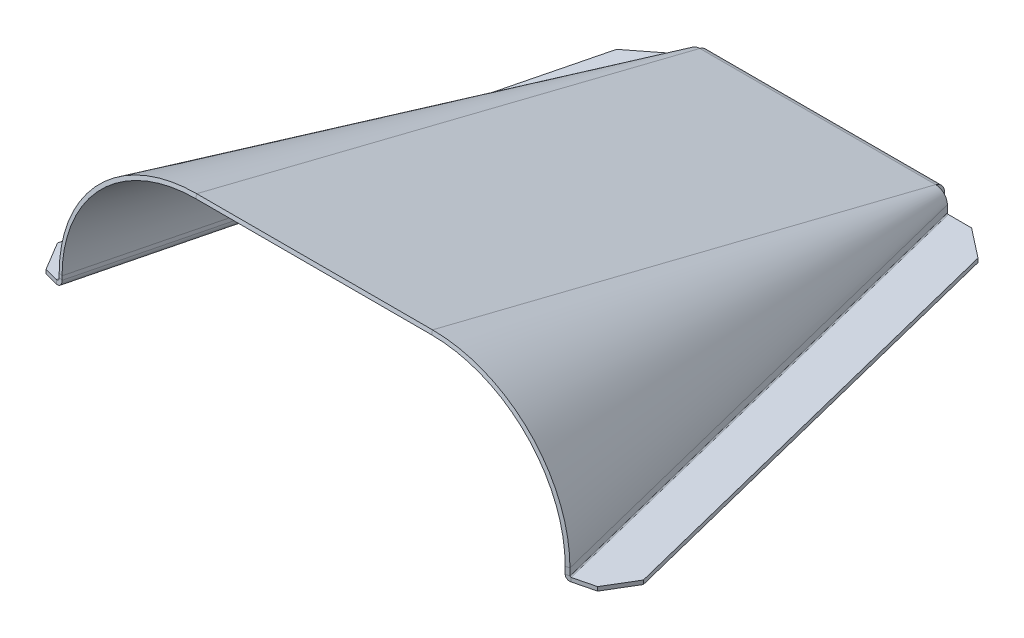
ISO-10303-21;
HEADER;
FILE_DESCRIPTION(('STEP AP214'),'2;1');
FILE_NAME('part.step','',(''),(''),'','','');
FILE_SCHEMA(('AUTOMOTIVE_DESIGN { 1 0 10303 214 1 1 1 1 }'));
ENDSEC;
DATA;
#1=APPLICATION_CONTEXT('core data for automotive mechanical design processes');
#2=APPLICATION_PROTOCOL_DEFINITION('international standard','automotive_design',2000,#1);
#3=PRODUCT_CONTEXT('',#1,'mechanical');
#4=PRODUCT('Part','Part','',(#3));
#5=PRODUCT_RELATED_PRODUCT_CATEGORY('part','',(#4));
#6=PRODUCT_DEFINITION_FORMATION('','',#4);
#7=PRODUCT_DEFINITION_CONTEXT('part definition',#1,'design');
#8=PRODUCT_DEFINITION('design','',#6,#7);
#9=PRODUCT_DEFINITION_SHAPE('','',#8);
#10=(LENGTH_UNIT() NAMED_UNIT(*) SI_UNIT(.MILLI.,.METRE.));
#11=(NAMED_UNIT(*) PLANE_ANGLE_UNIT() SI_UNIT($,.RADIAN.));
#12=(NAMED_UNIT(*) SI_UNIT($,.STERADIAN.) SOLID_ANGLE_UNIT());
#13=UNCERTAINTY_MEASURE_WITH_UNIT(LENGTH_MEASURE(1.E-05),#10,'distance_accuracy_value','');
#14=(GEOMETRIC_REPRESENTATION_CONTEXT(3) GLOBAL_UNCERTAINTY_ASSIGNED_CONTEXT((#13)) GLOBAL_UNIT_ASSIGNED_CONTEXT((#10,
#11,#12)) REPRESENTATION_CONTEXT('',''));
#15=CARTESIAN_POINT('',(0.,0.,0.));
#16=DIRECTION('',(0.,0.,1.));
#17=DIRECTION('',(1.,0.,0.));
#18=AXIS2_PLACEMENT_3D('',#15,#16,#17);
#19=CARTESIAN_POINT('',(-47.625,3.26979756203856,0.770050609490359));
#20=DIRECTION('',(-1.,0.,0.));
#21=DIRECTION('',(0.,-1.,0.));
#22=AXIS2_PLACEMENT_3D('',#19,#20,#21);
#23=PLANE('',#22);
#24=DIRECTION('',(0.,0.997061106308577,0.0766103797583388));
#25=VECTOR('',#24,1.);
#26=CARTESIAN_POINT('',(-47.625,-1.47870595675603,0.405193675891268));
#27=LINE('',#26,#25);
#28=CARTESIAN_POINT('',(-47.625,0.104128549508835,0.526812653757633));
#29=VERTEX_POINT('',#28);
#30=CARTESIAN_POINT('',(-47.625,-1.47870595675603,0.40519367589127));
#31=VERTEX_POINT('',#30);
#32=EDGE_CURVE('E369',#29,#31,#27,.F.);
#33=ORIENTED_EDGE('',*,*,#32,.F.);
#34=CARTESIAN_POINT('',(-47.625,3.26979756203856,0.770050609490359));
#35=DIRECTION('',(1.,0.,0.));
#36=DIRECTION('',(0.,1.,0.));
#37=AXIS2_PLACEMENT_3D('',#34,#35,#36);
#38=CIRCLE('',#37,3.175);
#39=CARTESIAN_POINT('',(-47.625,6.34999999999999,0.));
#40=VERTEX_POINT('',#39);
#41=EDGE_CURVE('E632',#40,#29,#38,.F.);
#42=ORIENTED_EDGE('',*,*,#41,.F.);
#43=DIRECTION('',(0.,0.970142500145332,-0.242535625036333));
#44=VECTOR('',#43,1.);
#45=CARTESIAN_POINT('',(-47.625,6.34999999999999,0.));
#46=LINE('',#45,#44);
#47=CARTESIAN_POINT('',(-47.625,7.89010121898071,-0.385025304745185));
#48=VERTEX_POINT('',#47);
#49=EDGE_CURVE('E529',#40,#48,#46,.T.);
#50=ORIENTED_EDGE('',*,*,#49,.T.);
#51=CARTESIAN_POINT('',(-47.625,3.26979756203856,0.770050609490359));
#52=DIRECTION('',(1.,0.,0.));
#53=DIRECTION('',(0.,1.,0.));
#54=AXIS2_PLACEMENT_3D('',#51,#52,#53);
#55=CIRCLE('',#54,4.7625);
#56=EDGE_CURVE('E638',#48,#31,#55,.F.);
#57=ORIENTED_EDGE('',*,*,#56,.T.);
#58=EDGE_LOOP('',(#33,#42,#50,#57));
#59=FACE_BOUND('',#58,.T.);
#60=ADVANCED_FACE('F160',(#59),#23,.T.);
#61=CARTESIAN_POINT('',(47.625,3.2697975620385,0.770050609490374));
#62=DIRECTION('',(-1.,0.,0.));
#63=DIRECTION('',(0.,-1.,0.));
#64=AXIS2_PLACEMENT_3D('',#61,#62,#63);
#65=PLANE('',#64);
#66=CARTESIAN_POINT('',(47.625,3.2697975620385,0.770050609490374));
#67=DIRECTION('',(1.,0.,0.));
#68=DIRECTION('',(0.,1.,0.));
#69=AXIS2_PLACEMENT_3D('',#66,#67,#68);
#70=CIRCLE('',#69,3.175);
#71=CARTESIAN_POINT('',(47.625,0.104128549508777,0.526812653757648));
#72=VERTEX_POINT('',#71);
#73=CARTESIAN_POINT('',(47.625,6.34999999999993,0.));
#74=VERTEX_POINT('',#73);
#75=EDGE_CURVE('E631',#72,#74,#70,.T.);
#76=ORIENTED_EDGE('',*,*,#75,.F.);
#77=DIRECTION('',(0.,0.997061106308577,0.0766103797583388));
#78=VECTOR('',#77,1.);
#79=CARTESIAN_POINT('',(47.625,0.104128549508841,0.526812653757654));
#80=LINE('',#79,#78);
#81=CARTESIAN_POINT('',(47.625,-1.47870595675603,0.405193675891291));
#82=VERTEX_POINT('',#81);
#83=EDGE_CURVE('E381',#72,#82,#80,.F.);
#84=ORIENTED_EDGE('',*,*,#83,.T.);
#85=CARTESIAN_POINT('',(47.625,3.2697975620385,0.770050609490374));
#86=DIRECTION('',(1.,0.,0.));
#87=DIRECTION('',(0.,1.,0.));
#88=AXIS2_PLACEMENT_3D('',#85,#86,#87);
#89=CIRCLE('',#88,4.7625);
#90=CARTESIAN_POINT('',(47.625,7.89010121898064,-0.385025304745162));
#91=VERTEX_POINT('',#90);
#92=EDGE_CURVE('E635',#82,#91,#89,.T.);
#93=ORIENTED_EDGE('',*,*,#92,.T.);
#94=DIRECTION('',(0.,0.970142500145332,-0.242535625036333));
#95=VECTOR('',#94,1.);
#96=CARTESIAN_POINT('',(47.625,6.35,0.));
#97=LINE('',#96,#95);
#98=EDGE_CURVE('E532',#74,#91,#97,.T.);
#99=ORIENTED_EDGE('',*,*,#98,.F.);
#100=EDGE_LOOP('',(#76,#84,#93,#99));
#101=FACE_BOUND('',#100,.T.);
#102=ADVANCED_FACE('F162',(#101),#65,.F.);
#103=CARTESIAN_POINT('',(47.625,3.2697975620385,0.770050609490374));
#104=DIRECTION('',(1.,0.,0.));
#105=DIRECTION('',(0.,-0.997061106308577,-0.0766103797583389));
#106=AXIS2_PLACEMENT_3D('',#103,#104,#105);
#107=CYLINDRICAL_SURFACE('',#106,4.7625);
#108=DIRECTION('',(1.,0.,0.));
#109=VECTOR('',#108,1.);
#110=CARTESIAN_POINT('',(-47.625,7.89010121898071,-0.385025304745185));
#111=LINE('',#110,#109);
#112=EDGE_CURVE('E488',#91,#48,#111,.F.);
#113=ORIENTED_EDGE('',*,*,#112,.F.);
#114=ORIENTED_EDGE('',*,*,#92,.F.);
#115=DIRECTION('',(1.,0.,0.));
#116=VECTOR('',#115,1.);
#117=CARTESIAN_POINT('',(-47.625,-1.47870595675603,0.40519367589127));
#118=LINE('',#117,#116);
#119=EDGE_CURVE('E379',#82,#31,#118,.F.);
#120=ORIENTED_EDGE('',*,*,#119,.T.);
#121=ORIENTED_EDGE('',*,*,#56,.F.);
#122=EDGE_LOOP('',(#113,#114,#120,#121));
#123=FACE_BOUND('',#122,.T.);
#124=ADVANCED_FACE('F711',(#123),#107,.T.);
#125=CARTESIAN_POINT('',(47.625,3.2697975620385,0.770050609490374));
#126=DIRECTION('',(1.,0.,0.));
#127=DIRECTION('',(0.,-0.997061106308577,-0.0766103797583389));
#128=AXIS2_PLACEMENT_3D('',#125,#126,#127);
#129=CYLINDRICAL_SURFACE('',#128,3.175);
#130=DIRECTION('',(-1.,0.,0.));
#131=VECTOR('',#130,1.);
#132=CARTESIAN_POINT('',(47.625,6.34999999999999,0.));
#133=LINE('',#132,#131);
#134=EDGE_CURVE('E455',#74,#40,#133,.T.);
#135=ORIENTED_EDGE('',*,*,#134,.T.);
#136=ORIENTED_EDGE('',*,*,#41,.T.);
#137=DIRECTION('',(1.,0.,0.));
#138=VECTOR('',#137,1.);
#139=CARTESIAN_POINT('',(-47.625,0.104128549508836,0.526812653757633));
#140=LINE('',#139,#138);
#141=EDGE_CURVE('E384',#29,#72,#140,.T.);
#142=ORIENTED_EDGE('',*,*,#141,.T.);
#143=ORIENTED_EDGE('',*,*,#75,.T.);
#144=EDGE_LOOP('',(#135,#136,#142,#143));
#145=FACE_BOUND('',#144,.T.);
#146=ADVANCED_FACE('F716',(#145),#129,.F.);
#147=CARTESIAN_POINT('',(-50.78459898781,1.58749999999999,0.00385025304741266));
#148=CARTESIAN_POINT('',(-50.7926217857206,1.16974059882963,0.0359414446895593));
#149=CARTESIAN_POINT('',(-50.8812119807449,0.752295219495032,0.047878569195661));
#150=CARTESIAN_POINT('',(-51.2073917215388,-0.0194852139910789,0.0345151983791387));
#151=CARTESIAN_POINT('',(-51.4448578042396,-0.373441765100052,0.00923945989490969));
#152=CARTESIAN_POINT('',(-52.0339590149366,-0.964136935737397,-0.0698542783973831));
#153=CARTESIAN_POINT('',(-52.3853686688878,-1.20064314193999,-0.123615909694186));
#154=CARTESIAN_POINT('',(-53.1501483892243,-1.52032506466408,-0.246629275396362));
#155=CARTESIAN_POINT('',(-53.5631498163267,-1.60337500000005,-0.315794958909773));
#156=CARTESIAN_POINT('',(-53.9764587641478,-1.60337500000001,-0.385025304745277));
#157=CARTESIAN_POINT('',(-50.7999999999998,1.58749999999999,0.));
#158=CARTESIAN_POINT('',(-50.8080227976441,1.17181901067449,0.0320911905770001));
#159=CARTESIAN_POINT('',(-50.8962121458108,0.756450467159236,0.044128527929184));
#160=CARTESIAN_POINT('',(-51.2208489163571,-0.0114902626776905,0.0311508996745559));
#161=CARTESIAN_POINT('',(-51.4571734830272,-0.36368583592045,0.00616054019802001));
#162=CARTESIAN_POINT('',(-52.0434236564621,-0.951442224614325,-0.0722204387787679));
#163=CARTESIAN_POINT('',(-52.3931249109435,-1.18677178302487,-0.125554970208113));
#164=CARTESIAN_POINT('',(-53.154179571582,-1.50486324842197,-0.24763707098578));
#165=CARTESIAN_POINT('',(-53.5651661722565,-1.58750000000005,-0.31629904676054));
#166=CARTESIAN_POINT('',(-53.9764587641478,-1.58750000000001,-0.385025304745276));
#167=CARTESIAN_POINT('',(-52.3401012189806,1.58749999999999,-0.385025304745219));
#168=CARTESIAN_POINT('',(-52.3481239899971,1.37966019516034,-0.35293422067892));
#169=CARTESIAN_POINT('',(-52.3962286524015,1.17197523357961,-0.330875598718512));
#170=CARTESIAN_POINT('',(-52.5665683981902,0.788004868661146,-0.305278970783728));
#171=CARTESIAN_POINT('',(-52.688741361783,0.611907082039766,-0.301731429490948));
#172=CARTESIAN_POINT('',(-52.989887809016,0.318028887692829,-0.308836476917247));
#173=CARTESIAN_POINT('',(-53.1687491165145,0.200364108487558,-0.319461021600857));
#174=CARTESIAN_POINT('',(-53.5572978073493,0.041318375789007,-0.348416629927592));
#175=CARTESIAN_POINT('',(-53.7668017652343,0.,-0.366707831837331));
#176=CARTESIAN_POINT('',(-53.9764587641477,0.,-0.385025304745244));
#177=CARTESIAN_POINT('',(-52.3556562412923,1.58749999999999,-0.388914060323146));
#178=CARTESIAN_POINT('',(-52.3636790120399,1.38175939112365,-0.356822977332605));
#179=CARTESIAN_POINT('',(-52.4113788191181,1.17617203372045,-0.334663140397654));
#180=CARTESIAN_POINT('',(-52.5801601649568,0.796079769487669,-0.308676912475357));
#181=CARTESIAN_POINT('',(-52.7011801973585,0.621760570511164,-0.304841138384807));
#182=CARTESIAN_POINT('',(-52.9994470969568,0.330850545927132,-0.311226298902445));
#183=CARTESIAN_POINT('',(-53.1765829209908,0.214374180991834,-0.321419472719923));
#184=CARTESIAN_POINT('',(-53.5613693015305,0.0569348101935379,-0.349434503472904));
#185=CARTESIAN_POINT('',(-53.7688382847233,0.0160337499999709,-0.367216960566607));
#186=CARTESIAN_POINT('',(-53.9764587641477,0.0160337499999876,-0.385025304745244));
#187=B_SPLINE_SURFACE_WITH_KNOTS('',1,3,((#147,#148,#149,#150,#151,#152,#153,#154,#155,#156),
(#157,#158,#159,#160,#161,#162,#163,#164,#165,#166),(#167,#168,#169,#170,#171,#172,#173,#174,
#175,#176),(#177,#178,#179,#180,#181,#182,#183,#184,#185,#186)),.UNSPECIFIED.,.F.,.F.,.F.,(2,1,
1,2),(4,2,2,2,4),(-0.01,0.,1.,1.0101),(0.,0.25,0.5,0.75,1.),.UNSPECIFIED.);
#188=DIRECTION('',(0.,-1.,0.));
#189=VECTOR('',#188,1.);
#190=CARTESIAN_POINT('',(-53.9764587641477,0.,-0.385025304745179));
#191=LINE('',#190,#189);
#192=CARTESIAN_POINT('',(-53.9764587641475,0.,-0.385025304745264));
#193=VERTEX_POINT('',#192);
#194=CARTESIAN_POINT('',(-53.9764587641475,-1.58750000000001,-0.385025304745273));
#195=VERTEX_POINT('',#194);
#196=EDGE_CURVE('E390',#193,#195,#191,.T.);
#197=CARTESIAN_POINT('',(-52.3401012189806,1.58749999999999,-0.385025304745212));
#198=CARTESIAN_POINT('',(-52.3411033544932,1.56152456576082,-0.381014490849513));
#199=CARTESIAN_POINT('',(-52.3427250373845,1.53554917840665,-0.377158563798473));
#200=CARTESIAN_POINT('',(-52.3472036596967,1.48366095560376,-0.369755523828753));
#201=CARTESIAN_POINT('',(-52.3500605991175,1.45774812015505,-0.366208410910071));
#202=CARTESIAN_POINT('',(-52.3570058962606,1.40604745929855,-0.359422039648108));
#203=CARTESIAN_POINT('',(-52.3610942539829,1.38025963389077,-0.356182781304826));
#204=CARTESIAN_POINT('',(-52.3704947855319,1.3288711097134,-0.350010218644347));
#205=CARTESIAN_POINT('',(-52.3758069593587,1.30327041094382,-0.347076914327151));
#206=CARTESIAN_POINT('',(-52.3876447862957,1.25231781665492,-0.341513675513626));
#207=CARTESIAN_POINT('',(-52.3941704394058,1.2269659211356,-0.338883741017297));
#208=CARTESIAN_POINT('',(-52.4084219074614,1.17657200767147,-0.333923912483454));
#209=CARTESIAN_POINT('',(-52.4161477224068,1.15152998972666,-0.331594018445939));
#210=CARTESIAN_POINT('',(-52.4327833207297,1.10181615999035,-0.327230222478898));
#211=CARTESIAN_POINT('',(-52.4416931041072,1.07714434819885,-0.325196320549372));
#212=CARTESIAN_POINT('',(-52.4606775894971,1.02823036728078,-0.321419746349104));
#213=CARTESIAN_POINT('',(-52.4707522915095,1.0039881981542,-0.319677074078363));
#214=CARTESIAN_POINT('',(-52.4920447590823,0.955991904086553,-0.31647749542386));
#215=CARTESIAN_POINT('',(-52.5032625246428,0.932237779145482,-0.315020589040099));
#216=CARTESIAN_POINT('',(-52.5268165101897,0.885274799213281,-0.312386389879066));
#217=CARTESIAN_POINT('',(-52.5391527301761,0.86206594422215,-0.311209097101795));
#218=CARTESIAN_POINT('',(-52.5649163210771,0.816249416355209,-0.309127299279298));
#219=CARTESIAN_POINT('',(-52.5783436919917,0.793641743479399,-0.308222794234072));
#220=CARTESIAN_POINT('',(-52.6062596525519,0.749082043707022,-0.306679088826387));
#221=CARTESIAN_POINT('',(-52.6207482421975,0.727130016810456,-0.306039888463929));
#222=CARTESIAN_POINT('',(-52.6507541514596,0.6839344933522,-0.305018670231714));
#223=CARTESIAN_POINT('',(-52.6662714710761,0.662690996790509,-0.304636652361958));
#224=CARTESIAN_POINT('',(-52.6982998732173,0.620963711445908,-0.304121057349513));
#225=CARTESIAN_POINT('',(-52.714810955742,0.600479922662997,-0.303987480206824));
#226=CARTESIAN_POINT('',(-52.748789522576,0.560321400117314,-0.303959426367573));
#227=CARTESIAN_POINT('',(-52.7662570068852,0.540646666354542,-0.304064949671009));
#228=CARTESIAN_POINT('',(-52.8021087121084,0.502153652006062,-0.304505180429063));
#229=CARTESIAN_POINT('',(-52.8204929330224,0.483335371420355,-0.304839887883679));
#230=CARTESIAN_POINT('',(-52.8581362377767,0.446600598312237,-0.305728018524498));
#231=CARTESIAN_POINT('',(-52.877395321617,0.428684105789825,-0.3062814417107));
#232=CARTESIAN_POINT('',(-52.916744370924,0.393796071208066,-0.307596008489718));
#233=CARTESIAN_POINT('',(-52.9368343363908,0.376824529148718,-0.308357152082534));
#234=CARTESIAN_POINT('',(-52.9777991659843,0.343867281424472,-0.310075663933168));
#235=CARTESIAN_POINT('',(-52.998674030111,0.327881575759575,-0.311033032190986));
#236=CARTESIAN_POINT('',(-53.0411607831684,0.296934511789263,-0.313132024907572));
#237=CARTESIAN_POINT('',(-53.062772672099,0.281973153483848,-0.314273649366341));
#238=CARTESIAN_POINT('',(-53.1066838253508,0.253110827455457,-0.31672874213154));
#239=CARTESIAN_POINT('',(-53.1289830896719,0.239209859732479,-0.318042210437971));
#240=CARTESIAN_POINT('',(-53.1742176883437,0.212501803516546,-0.320828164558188));
#241=CARTESIAN_POINT('',(-53.1971530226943,0.199694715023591,-0.322300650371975));
#242=CARTESIAN_POINT('',(-53.243606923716,0.175205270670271,-0.325391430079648));
#243=CARTESIAN_POINT('',(-53.2671254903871,0.163522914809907,-0.327009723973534));
#244=CARTESIAN_POINT('',(-53.3146916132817,0.141311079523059,-0.330378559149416));
#245=CARTESIAN_POINT('',(-53.3387391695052,0.130781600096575,-0.332129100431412));
#246=CARTESIAN_POINT('',(-53.3873077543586,0.110900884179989,-0.335748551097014));
#247=CARTESIAN_POINT('',(-53.4118287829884,0.101549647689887,-0.337617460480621));
#248=CARTESIAN_POINT('',(-53.4612876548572,0.0840479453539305,-0.341459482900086));
#249=CARTESIAN_POINT('',(-53.4862254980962,0.0758974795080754,-0.343432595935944));
#250=CARTESIAN_POINT('',(-53.5364603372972,0.0608169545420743,-0.347468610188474));
#251=CARTESIAN_POINT('',(-53.5617573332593,0.0538868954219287,-0.349531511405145));
#252=CARTESIAN_POINT('',(-53.6126519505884,0.0412638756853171,-0.353732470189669));
#253=CARTESIAN_POINT('',(-53.6382495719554,0.0355709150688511,-0.355870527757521));
#254=CARTESIAN_POINT('',(-53.6896861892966,0.0254358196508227,-0.360206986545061));
#255=CARTESIAN_POINT('',(-53.7155251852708,0.0209936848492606,-0.36240538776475));
#256=CARTESIAN_POINT('',(-53.7673847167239,0.0133708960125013,-0.36684757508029));
#257=CARTESIAN_POINT('',(-53.7934052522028,0.010190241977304,-0.369091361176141));
#258=CARTESIAN_POINT('',(-53.8455676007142,0.0050982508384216,-0.373609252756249));
#259=CARTESIAN_POINT('',(-53.8717094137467,0.00318691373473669,-0.375883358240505));
#260=CARTESIAN_POINT('',(-53.9240537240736,0.000637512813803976,-0.380446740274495));
#261=CARTESIAN_POINT('',(-53.9502562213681,-5.51003444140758E-07,-0.382736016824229));
#262=CARTESIAN_POINT('',(-53.9764587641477,0.,-0.38502530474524));
#263=B_SPLINE_CURVE_WITH_KNOTS('',3,(#197,#198,#199,#200,#201,#202,#203,#204,#205,#206,#207,
#208,#209,#210,#211,#212,#213,#214,#215,#216,#217,#218,#219,#220,#221,#222,#223,#224,#225,#226,
#227,#228,#229,#230,#231,#232,#233,#234,#235,#236,#237,#238,#239,#240,#241,#242,#243,#244,#245,
#246,#247,#248,#249,#250,#251,#252,#253,#254,#255,#256,#257,#258,#259,#260,#261,#262),
.UNSPECIFIED.,.F.,.F.,(4,2,2,2,2,2,2,2,2,2,2,2,2,2,2,2,2,2,2,2,2,2,2,2,2,2,2,2,2,2,2,2,4),(0.,
0.0788992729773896,0.157798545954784,0.236697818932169,0.315597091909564,0.394496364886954,
0.473395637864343,0.55229491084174,0.631194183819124,0.710093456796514,0.788992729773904,
0.867892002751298,0.946791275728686,1.02569054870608,1.10458982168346,1.18348909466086,
1.26238836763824,1.34128764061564,1.42018691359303,1.49908618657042,1.57798545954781,
1.6568847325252,1.73578400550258,1.81468327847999,1.89358255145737,1.97248182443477,
2.05138109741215,2.13028037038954,2.20917964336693,2.28807891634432,2.36697818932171,
2.44587746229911,2.52477673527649),.UNSPECIFIED.);
#264=CARTESIAN_POINT('',(-52.3401012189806,1.58749999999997,-0.385025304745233));
#265=VERTEX_POINT('',#264);
#266=EDGE_CURVE('E600',#265,#193,#263,.T.);
#267=DIRECTION('',(0.970142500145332,0.,0.242535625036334));
#268=VECTOR('',#267,1.);
#269=CARTESIAN_POINT('',(-52.3401012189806,1.58749999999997,-0.385025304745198));
#270=LINE('',#269,#268);
#271=CARTESIAN_POINT('',(-50.8,1.58749999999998,0.));
#272=VERTEX_POINT('',#271);
#273=EDGE_CURVE('E628',#265,#272,#270,.T.);
#274=CARTESIAN_POINT('',(-50.7999999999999,1.58749999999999,0.));
#275=CARTESIAN_POINT('',(-50.8010016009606,1.53554913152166,0.00401094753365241));
#276=CARTESIAN_POINT('',(-50.8032422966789,1.48359835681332,0.00771212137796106));
#277=CARTESIAN_POINT('',(-50.8101942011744,1.37982191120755,0.0144968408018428));
#278=CARTESIAN_POINT('',(-50.8149054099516,1.32799624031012,0.0175803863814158));
#279=CARTESIAN_POINT('',(-50.8267906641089,1.22459491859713,0.0231317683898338));
#280=CARTESIAN_POINT('',(-50.8339647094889,1.17301926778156,0.0255996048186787));
#281=CARTESIAN_POINT('',(-50.8507604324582,1.07024221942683,0.0299233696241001));
#282=CARTESIAN_POINT('',(-50.8603821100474,1.01904082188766,0.0317792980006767));
#283=CARTESIAN_POINT('',(-50.8820524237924,0.917135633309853,0.0348844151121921));
#284=CARTESIAN_POINT('',(-50.8941010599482,0.86643184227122,0.0361336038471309));
#285=CARTESIAN_POINT('',(-50.9205986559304,0.765644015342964,0.0380319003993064));
#286=CARTESIAN_POINT('',(-50.9350476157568,0.71555997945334,0.038681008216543));
#287=CARTESIAN_POINT('',(-50.9663134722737,0.616132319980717,0.0393872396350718));
#288=CARTESIAN_POINT('',(-50.9831303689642,0.566788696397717,0.039444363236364));
#289=CARTESIAN_POINT('',(-51.0190939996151,0.468960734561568,0.0389761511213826));
#290=CARTESIAN_POINT('',(-51.0382407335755,0.420476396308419,0.0384508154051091));
#291=CARTESIAN_POINT('',(-51.0788203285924,0.324483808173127,0.0368286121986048));
#292=CARTESIAN_POINT('',(-51.1002531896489,0.276975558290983,0.035731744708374));
#293=CARTESIAN_POINT('',(-51.1453558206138,0.18304959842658,0.0329787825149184));
#294=CARTESIAN_POINT('',(-51.1690255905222,0.13663188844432,0.0313226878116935));
#295=CARTESIAN_POINT('',(-51.2185474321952,0.044998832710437,0.0274649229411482));
#296=CARTESIAN_POINT('',(-51.24439950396,-0.000216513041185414,0.0252632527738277));
#297=CARTESIAN_POINT('',(-51.2982260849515,-0.089335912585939,0.0203293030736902));
#298=CARTESIAN_POINT('',(-51.3262005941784,-0.13323996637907,0.0175970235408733));
#299=CARTESIAN_POINT('',(-51.3842070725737,-0.219631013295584,0.0116180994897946));
#300=CARTESIAN_POINT('',(-51.4142390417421,-0.262118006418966,0.00837145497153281));
#301=CARTESIAN_POINT('',(-51.4762905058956,-0.345572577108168,0.00138128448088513));
#302=CARTESIAN_POINT('',(-51.5083100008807,-0.386540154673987,-0.00236224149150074));
#303=CARTESIAN_POINT('',(-51.5742617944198,-0.466857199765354,-0.0103274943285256));
#304=CARTESIAN_POINT('',(-51.6081940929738,-0.506206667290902,-0.0145492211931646));
#305=CARTESIAN_POINT('',(-51.6778921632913,-0.58319269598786,-0.0234510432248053));
#306=CARTESIAN_POINT('',(-51.7136579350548,-0.620829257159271,-0.0281311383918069));
#307=CARTESIAN_POINT('',(-51.7869392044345,-0.694298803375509,-0.0379287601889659));
#308=CARTESIAN_POINT('',(-51.8244547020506,-0.730131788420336,-0.0430462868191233));
#309=CARTESIAN_POINT('',(-51.9011474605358,-0.799907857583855,-0.0536967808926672));
#310=CARTESIAN_POINT('',(-51.9403247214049,-0.833850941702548,-0.0592297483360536));
#311=CARTESIAN_POINT('',(-52.020249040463,-0.899765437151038,-0.0706881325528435));
#312=CARTESIAN_POINT('',(-52.060996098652,-0.931736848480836,-0.0766135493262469));
#313=CARTESIAN_POINT('',(-52.1439642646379,-0.993630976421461,-0.0888328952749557));
#314=CARTESIAN_POINT('',(-52.1861853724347,-1.02355369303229,-0.0951268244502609));
#315=CARTESIAN_POINT('',(-52.2720023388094,-1.08127834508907,-0.108058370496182));
#316=CARTESIAN_POINT('',(-52.3155981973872,-1.10908028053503,-0.114695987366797));
#317=CARTESIAN_POINT('',(-52.4040620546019,-1.16249639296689,-0.128289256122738));
#318=CARTESIAN_POINT('',(-52.4489300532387,-1.1881105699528,-0.135244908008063));
#319=CARTESIAN_POINT('',(-52.5398325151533,-1.23708945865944,-0.149447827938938));
#320=CARTESIAN_POINT('',(-52.5858669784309,-1.26045417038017,-0.156695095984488));
#321=CARTESIAN_POINT('',(-52.6789938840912,-1.30487784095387,-0.171454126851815));
#322=CARTESIAN_POINT('',(-52.7260863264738,-1.32593679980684,-0.178965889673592));
#323=CARTESIAN_POINT('',(-52.8212181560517,-1.36569823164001,-0.194226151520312));
#324=CARTESIAN_POINT('',(-52.869257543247,-1.38440070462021,-0.201974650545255));
#325=CARTESIAN_POINT('',(-52.9661699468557,-1.41940410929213,-0.217680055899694));
#326=CARTESIAN_POINT('',(-53.0150429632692,-1.43570504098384,-0.22563696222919));
#327=CARTESIAN_POINT('',(-53.1135073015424,-1.46586609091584,-0.241730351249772));
#328=CARTESIAN_POINT('',(-53.1630986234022,-1.47972620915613,-0.249866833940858));
#329=CARTESIAN_POINT('',(-53.2628825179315,-1.50497224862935,-0.266290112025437));
#330=CARTESIAN_POINT('',(-53.313075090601,-1.51635816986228,-0.274576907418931));
#331=CARTESIAN_POINT('',(-53.4139429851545,-1.53662836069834,-0.291271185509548));
#332=CARTESIAN_POINT('',(-53.4646183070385,-1.54551263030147,-0.299678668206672));
#333=CARTESIAN_POINT('',(-53.5663320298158,-1.56075820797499,-0.316584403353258));
#334=CARTESIAN_POINT('',(-53.6173704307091,-1.56711951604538,-0.325082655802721));
#335=CARTESIAN_POINT('',(-53.719689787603,-1.57730349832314,-0.342139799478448));
#336=CARTESIAN_POINT('',(-53.7709707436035,-1.58112617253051,-0.350698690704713));
#337=CARTESIAN_POINT('',(-53.8736540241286,-1.58622497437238,-0.367846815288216));
#338=CARTESIAN_POINT('',(-53.9250563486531,-1.58750110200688,-0.376436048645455));
#339=CARTESIAN_POINT('',(-53.9764587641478,-1.58750000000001,-0.385025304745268));
#340=B_SPLINE_CURVE_WITH_KNOTS('',3,(#274,#275,#276,#277,#278,#279,#280,#281,#282,#283,#284,
#285,#286,#287,#288,#289,#290,#291,#292,#293,#294,#295,#296,#297,#298,#299,#300,#301,#302,#303,
#304,#305,#306,#307,#308,#309,#310,#311,#312,#313,#314,#315,#316,#317,#318,#319,#320,#321,#322,
#323,#324,#325,#326,#327,#328,#329,#330,#331,#332,#333,#334,#335,#336,#337,#338,#339),
.UNSPECIFIED.,.F.,.F.,(4,2,2,2,2,2,2,2,2,2,2,2,2,2,2,2,2,2,2,2,2,2,2,2,2,2,2,2,2,2,2,2,4),(0.,
0.156329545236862,0.312659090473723,0.468988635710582,0.625318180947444,0.781647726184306,
0.937977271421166,1.09430681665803,1.25063636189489,1.40696590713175,1.56329545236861,
1.71962499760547,1.87595454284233,2.0322840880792,2.18861363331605,2.34494317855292,
2.50127272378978,2.65760226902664,2.8139318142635,2.97026135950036,3.12659090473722,
3.28292044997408,3.43924999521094,3.59557954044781,3.75190908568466,3.90823863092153,
4.06456817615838,4.22089772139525,4.37722726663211,4.53355681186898,4.68988635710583,
4.84621590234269,5.00254544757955),.UNSPECIFIED.);
#341=EDGE_CURVE('E616',#272,#195,#340,.T.);
#342=ORIENTED_EDGE('',*,*,#196,.F.);
#343=ORIENTED_EDGE('',*,*,#266,.F.);
#344=ORIENTED_EDGE('',*,*,#273,.T.);
#345=ORIENTED_EDGE('',*,*,#341,.T.);
#346=EDGE_LOOP('',(#342,#343,#344,#345));
#347=FACE_BOUND('',#346,.T.);
#348=ADVANCED_FACE('F723',(#347),#187,.F.);
#349=CARTESIAN_POINT('',(-104.680202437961,1.58749999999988,202.42994939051));
#350=DIRECTION('',(0.242535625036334,0.,-0.970142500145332));
#351=DIRECTION('',(-0.970142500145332,0.,-0.242535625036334));
#352=AXIS2_PLACEMENT_3D('',#349,#350,#351);
#353=PLANE('',#352);
#354=CARTESIAN_POINT('',(-104.680202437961,1.58749999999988,202.42994939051));
#355=DIRECTION('',(-0.242535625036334,0.,0.970142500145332));
#356=DIRECTION('',(0.970142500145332,0.,0.242535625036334));
#357=AXIS2_PLACEMENT_3D('',#354,#355,#356);
#358=CIRCLE('',#357,1.58749999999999);
#359=CARTESIAN_POINT('',(-104.680202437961,-1.12323345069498E-13,202.42994939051));
#360=VERTEX_POINT('',#359);
#361=CARTESIAN_POINT('',(-103.140101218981,1.58749999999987,202.814974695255));
#362=VERTEX_POINT('',#361);
#363=EDGE_CURVE('E770',#360,#362,#358,.T.);
#364=ORIENTED_EDGE('',*,*,#363,.F.);
#365=DIRECTION('',(0.,-1.,0.));
#366=VECTOR('',#365,1.);
#367=CARTESIAN_POINT('',(-104.680202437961,-1.34498091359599E-13,202.42994939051));
#368=LINE('',#367,#366);
#369=CARTESIAN_POINT('',(-104.680202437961,-1.58750000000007,202.42994939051));
#370=VERTEX_POINT('',#369);
#371=EDGE_CURVE('E389',#360,#370,#368,.T.);
#372=ORIENTED_EDGE('',*,*,#371,.T.);
#373=CARTESIAN_POINT('',(-104.680202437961,1.58749999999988,202.42994939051));
#374=DIRECTION('',(-0.242535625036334,0.,0.970142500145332));
#375=DIRECTION('',(0.970142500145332,0.,0.242535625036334));
#376=AXIS2_PLACEMENT_3D('',#373,#374,#375);
#377=CIRCLE('',#376,3.17499999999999);
#378=CARTESIAN_POINT('',(-101.6,1.58749999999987,203.2));
#379=VERTEX_POINT('',#378);
#380=EDGE_CURVE('E605',#370,#379,#377,.T.);
#381=ORIENTED_EDGE('',*,*,#380,.T.);
#382=DIRECTION('',(0.970142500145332,0.,0.242535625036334));
#383=VECTOR('',#382,1.);
#384=CARTESIAN_POINT('',(-103.140101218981,1.58749999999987,202.814974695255));
#385=LINE('',#384,#383);
#386=EDGE_CURVE('E620',#362,#379,#385,.T.);
#387=ORIENTED_EDGE('',*,*,#386,.F.);
#388=EDGE_LOOP('',(#364,#372,#381,#387));
#389=FACE_BOUND('',#388,.T.);
#390=ADVANCED_FACE('F596',(#389),#353,.F.);
#391=CARTESIAN_POINT('',(-104.680202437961,1.58749999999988,202.42994939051));
#392=DIRECTION('',(-0.242535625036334,0.,0.970142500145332));
#393=DIRECTION('',(0.,-1.,0.));
#394=AXIS2_PLACEMENT_3D('',#391,#392,#393);
#395=CYLINDRICAL_SURFACE('',#394,3.17499999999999);
#396=DIRECTION('',(-0.242535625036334,0.,0.970142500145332));
#397=VECTOR('',#396,1.);
#398=CARTESIAN_POINT('',(-101.6,1.58749999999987,203.2));
#399=LINE('',#398,#397);
#400=EDGE_CURVE('E608',#379,#272,#399,.F.);
#401=ORIENTED_EDGE('',*,*,#400,.F.);
#402=ORIENTED_EDGE('',*,*,#380,.F.);
#403=DIRECTION('',(0.242535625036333,0.,-0.970142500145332));
#404=VECTOR('',#403,1.);
#405=CARTESIAN_POINT('',(-104.680202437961,-1.58750000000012,202.42994939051));
#406=LINE('',#405,#404);
#407=EDGE_CURVE('E393',#370,#195,#406,.T.);
#408=ORIENTED_EDGE('',*,*,#407,.T.);
#409=ORIENTED_EDGE('',*,*,#341,.F.);
#410=EDGE_LOOP('',(#401,#402,#408,#409));
#411=FACE_BOUND('',#410,.T.);
#412=ADVANCED_FACE('F594',(#411),#395,.T.);
#413=CARTESIAN_POINT('',(-104.680202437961,1.58749999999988,202.42994939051));
#414=DIRECTION('',(-0.242535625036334,0.,0.970142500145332));
#415=DIRECTION('',(0.,-1.,0.));
#416=AXIS2_PLACEMENT_3D('',#413,#414,#415);
#417=CYLINDRICAL_SURFACE('',#416,1.58749999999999);
#418=DIRECTION('',(-0.242535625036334,0.,0.970142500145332));
#419=VECTOR('',#418,1.);
#420=CARTESIAN_POINT('',(-103.140101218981,1.58749999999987,202.814974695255));
#421=LINE('',#420,#419);
#422=EDGE_CURVE('E606',#362,#265,#421,.F.);
#423=ORIENTED_EDGE('',*,*,#422,.T.);
#424=ORIENTED_EDGE('',*,*,#266,.T.);
#425=DIRECTION('',(-0.242535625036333,0.,0.970142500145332));
#426=VECTOR('',#425,1.);
#427=CARTESIAN_POINT('',(-53.9764587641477,0.,-0.385025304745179));
#428=LINE('',#427,#426);
#429=EDGE_CURVE('E387',#193,#360,#428,.T.);
#430=ORIENTED_EDGE('',*,*,#429,.T.);
#431=ORIENTED_EDGE('',*,*,#363,.T.);
#432=EDGE_LOOP('',(#423,#424,#430,#431));
#433=FACE_BOUND('',#432,.T.);
#434=ADVANCED_FACE('F584',(#433),#417,.F.);
#435=CARTESIAN_POINT('',(-101.6,3.17499999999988,203.2));
#436=DIRECTION('',(-0.242535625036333,0.,0.970142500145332));
#437=DIRECTION('',(0.,-1.,0.));
#438=AXIS2_PLACEMENT_3D('',#435,#436,#437);
#439=PLANE('',#438);
#440=DIRECTION('',(0.,1.,0.));
#441=VECTOR('',#440,1.);
#442=CARTESIAN_POINT('',(-103.140101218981,0.,202.814974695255));
#443=LINE('',#442,#441);
#444=CARTESIAN_POINT('',(-103.140101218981,3.17500000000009,202.814974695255));
#445=VERTEX_POINT('',#444);
#446=EDGE_CURVE('E474',#445,#362,#443,.F.);
#447=ORIENTED_EDGE('',*,*,#446,.T.);
#448=ORIENTED_EDGE('',*,*,#386,.T.);
#449=DIRECTION('',(0.,-1.,0.));
#450=VECTOR('',#449,1.);
#451=CARTESIAN_POINT('',(-101.6,3.17499999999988,203.2));
#452=LINE('',#451,#450);
#453=CARTESIAN_POINT('',(-101.6,3.17500000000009,203.2));
#454=VERTEX_POINT('',#453);
#455=EDGE_CURVE('E439',#454,#379,#452,.T.);
#456=ORIENTED_EDGE('',*,*,#455,.F.);
#457=DIRECTION('',(-0.970142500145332,0.,-0.242535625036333));
#458=VECTOR('',#457,1.);
#459=CARTESIAN_POINT('',(-101.6,3.17500000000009,203.2));
#460=LINE('',#459,#458);
#461=EDGE_CURVE('E525',#454,#445,#460,.T.);
#462=ORIENTED_EDGE('',*,*,#461,.T.);
#463=EDGE_LOOP('',(#447,#448,#456,#462));
#464=FACE_BOUND('',#463,.T.);
#465=ADVANCED_FACE('F593',(#464),#439,.T.);
#466=CARTESIAN_POINT('',(-52.3401012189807,0.,-0.385025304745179));
#467=DIRECTION('',(0.970142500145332,0.,0.242535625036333));
#468=DIRECTION('',(0.242535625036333,0.,-0.970142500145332));
#469=AXIS2_PLACEMENT_3D('',#466,#467,#468);
#470=PLANE('',#469);
#471=ORIENTED_EDGE('',*,*,#422,.F.);
#472=ORIENTED_EDGE('',*,*,#446,.F.);
#473=DIRECTION('',(-0.242535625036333,0.,0.970142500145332));
#474=VECTOR('',#473,1.);
#475=CARTESIAN_POINT('',(-52.3401012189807,3.175,-0.385025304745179));
#476=LINE('',#475,#474);
#477=CARTESIAN_POINT('',(-52.3401012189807,3.175,-0.385025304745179));
#478=VERTEX_POINT('',#477);
#479=EDGE_CURVE('E494',#478,#445,#476,.T.);
#480=ORIENTED_EDGE('',*,*,#479,.F.);
#481=DIRECTION('',(0.,1.,0.));
#482=VECTOR('',#481,1.);
#483=CARTESIAN_POINT('',(-52.3401012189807,0.,-0.385025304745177));
#484=LINE('',#483,#482);
#485=EDGE_CURVE('E498',#478,#265,#484,.F.);
#486=ORIENTED_EDGE('',*,*,#485,.T.);
#487=EDGE_LOOP('',(#471,#472,#480,#486));
#488=FACE_BOUND('',#487,.T.);
#489=ADVANCED_FACE('F767',(#488),#470,.F.);
#490=CARTESIAN_POINT('',(-50.8,0.,0.));
#491=DIRECTION('',(0.970142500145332,0.,0.242535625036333));
#492=DIRECTION('',(0.242535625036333,0.,-0.970142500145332));
#493=AXIS2_PLACEMENT_3D('',#490,#491,#492);
#494=PLANE('',#493);
#495=ORIENTED_EDGE('',*,*,#455,.T.);
#496=ORIENTED_EDGE('',*,*,#400,.T.);
#497=DIRECTION('',(0.,-1.,0.));
#498=VECTOR('',#497,1.);
#499=CARTESIAN_POINT('',(-50.8,3.17499999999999,0.));
#500=LINE('',#499,#498);
#501=CARTESIAN_POINT('',(-50.8,3.175,0.));
#502=VERTEX_POINT('',#501);
#503=EDGE_CURVE('E440',#502,#272,#500,.T.);
#504=ORIENTED_EDGE('',*,*,#503,.F.);
#505=DIRECTION('',(-0.242535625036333,0.,0.970142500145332));
#506=VECTOR('',#505,1.);
#507=CARTESIAN_POINT('',(-50.8,3.175,0.));
#508=LINE('',#507,#506);
#509=EDGE_CURVE('E443',#502,#454,#508,.T.);
#510=ORIENTED_EDGE('',*,*,#509,.T.);
#511=EDGE_LOOP('',(#495,#496,#504,#510));
#512=FACE_BOUND('',#511,.T.);
#513=ADVANCED_FACE('F577',(#512),#494,.T.);
#514=CARTESIAN_POINT('',(103.509725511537,0.381000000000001,202.722568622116));
#515=DIRECTION('',(0.242535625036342,0.,0.97014250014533));
#516=DIRECTION('',(0.97014250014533,0.,-0.242535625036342));
#517=AXIS2_PLACEMENT_3D('',#514,#515,#516);
#518=PLANE('',#517);
#519=DIRECTION('',(0.,-1.,0.));
#520=VECTOR('',#519,1.);
#521=CARTESIAN_POINT('',(103.509725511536,0.,202.722568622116));
#522=LINE('',#521,#520);
#523=CARTESIAN_POINT('',(103.509725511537,0.,202.722568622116));
#524=VERTEX_POINT('',#523);
#525=CARTESIAN_POINT('',(103.509725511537,-1.58750000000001,202.722568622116));
#526=VERTEX_POINT('',#525);
#527=EDGE_CURVE('E414',#524,#526,#522,.T.);
#528=ORIENTED_EDGE('',*,*,#527,.F.);
#529=CARTESIAN_POINT('',(103.509725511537,0.381000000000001,202.722568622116));
#530=DIRECTION('',(-0.242535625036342,0.,-0.97014250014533));
#531=DIRECTION('',(-0.97014250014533,0.,0.242535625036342));
#532=AXIS2_PLACEMENT_3D('',#529,#530,#531);
#533=CIRCLE('',#532,0.381000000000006);
#534=CARTESIAN_POINT('',(103.140101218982,0.380999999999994,202.814974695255));
#535=VERTEX_POINT('',#534);
#536=EDGE_CURVE('E539',#535,#524,#533,.F.);
#537=ORIENTED_EDGE('',*,*,#536,.F.);
#538=DIRECTION('',(-0.970142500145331,0.,0.242535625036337));
#539=VECTOR('',#538,1.);
#540=CARTESIAN_POINT('',(103.140101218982,0.380999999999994,202.814974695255));
#541=LINE('',#540,#539);
#542=CARTESIAN_POINT('',(101.6,0.380999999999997,203.2));
#543=VERTEX_POINT('',#542);
#544=EDGE_CURVE('E771',#535,#543,#541,.T.);
#545=ORIENTED_EDGE('',*,*,#544,.T.);
#546=CARTESIAN_POINT('',(103.509725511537,0.381000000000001,202.722568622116));
#547=DIRECTION('',(-0.242535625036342,0.,-0.97014250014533));
#548=DIRECTION('',(-0.97014250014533,0.,0.242535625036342));
#549=AXIS2_PLACEMENT_3D('',#546,#547,#548);
#550=CIRCLE('',#549,1.96850000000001);
#551=EDGE_CURVE('E544',#543,#526,#550,.F.);
#552=ORIENTED_EDGE('',*,*,#551,.T.);
#553=EDGE_LOOP('',(#528,#537,#545,#552));
#554=FACE_BOUND('',#553,.T.);
#555=ADVANCED_FACE('F574',(#554),#518,.T.);
#556=CARTESIAN_POINT('',(52.7328270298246,-1.60337499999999,-0.385025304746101));
#557=CARTESIAN_POINT('',(52.4788576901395,-1.60337500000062,-0.329716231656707));
#558=CARTESIAN_POINT('',(52.225078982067,-1.55172703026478,-0.274451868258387));
#559=CARTESIAN_POINT('',(51.7555962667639,-1.35291986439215,-0.173444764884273));
#560=CARTESIAN_POINT('',(51.540121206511,-1.20583889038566,-0.127757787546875));
#561=CARTESIAN_POINT('',(51.1798912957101,-0.838491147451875,-0.0540638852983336));
#562=CARTESIAN_POINT('',(51.0352766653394,-0.61836891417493,-0.0260920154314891));
#563=CARTESIAN_POINT('',(50.8385551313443,-0.13840595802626,0.0067247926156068));
#564=CARTESIAN_POINT('',(50.7865244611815,0.121199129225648,0.011552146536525));
#565=CARTESIAN_POINT('',(50.7845989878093,0.380999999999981,0.00385025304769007));
#566=CARTESIAN_POINT('',(52.7328270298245,-1.58749999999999,-0.385025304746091));
#567=CARTESIAN_POINT('',(52.4808740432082,-1.58750000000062,-0.330220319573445));
#568=CARTESIAN_POINT('',(52.2291101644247,-1.53626521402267,-0.275459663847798));
#569=CARTESIAN_POINT('',(51.7633525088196,-1.33904850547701,-0.175383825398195));
#570=CARTESIAN_POINT('',(51.5495858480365,-1.19314417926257,-0.130123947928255));
#571=CARTESIAN_POINT('',(51.1922069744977,-0.82873521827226,-0.0571428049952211));
#572=CARTESIAN_POINT('',(51.0487338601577,-0.61037396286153,-0.0294563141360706));
#573=CARTESIAN_POINT('',(50.8535552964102,-0.13425071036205,0.00297475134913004));
#574=CARTESIAN_POINT('',(50.8019254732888,0.123277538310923,0.00770189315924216));
#575=CARTESIAN_POINT('',(50.7999999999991,0.380999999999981,2.38145007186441E-13));
#576=CARTESIAN_POINT('',(52.7328270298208,0.,-0.385025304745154));
#577=CARTESIAN_POINT('',(52.6825093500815,-1.12097901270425E-13,-0.380629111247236));
#578=CARTESIAN_POINT('',(52.632228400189,0.00991641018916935,-0.376239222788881));
#579=CARTESIAN_POINT('',(52.5389767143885,0.048087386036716,-0.369289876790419));
#580=CARTESIAN_POINT('',(52.4960500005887,0.0763269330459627,-0.366739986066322));
#581=CARTESIAN_POINT('',(52.4237748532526,0.14685769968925,-0.36503477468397));
#582=CARTESIAN_POINT('',(52.3944533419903,0.189121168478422,-0.36588618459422));
#583=CARTESIAN_POINT('',(52.3535718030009,0.281274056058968,-0.372029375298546));
#584=CARTESIAN_POINT('',(52.3420266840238,0.331118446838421,-0.37732344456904));
#585=CARTESIAN_POINT('',(52.3401012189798,0.381000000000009,-0.385025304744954));
#586=CARTESIAN_POINT('',(52.7328270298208,0.0160337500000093,-0.385025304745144));
#587=CARTESIAN_POINT('',(52.6845458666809,0.016033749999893,-0.381138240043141));
#588=CARTESIAN_POINT('',(52.6362998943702,0.0255328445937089,-0.377257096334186));
#589=CARTESIAN_POINT('',(52.5468105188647,0.0620974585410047,-0.37124832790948));
#590=CARTESIAN_POINT('',(52.5056092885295,0.0891485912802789,-0.369129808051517));
#591=CARTESIAN_POINT('',(52.436213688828,0.156711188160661,-0.368144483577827));
#592=CARTESIAN_POINT('',(52.4080451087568,0.197196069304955,-0.369284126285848));
#593=CARTESIAN_POINT('',(52.3687219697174,0.285470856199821,-0.375816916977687));
#594=CARTESIAN_POINT('',(52.3575817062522,0.333217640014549,-0.381212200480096));
#595=CARTESIAN_POINT('',(52.3556562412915,0.381000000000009,-0.388914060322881));
#596=B_SPLINE_SURFACE_WITH_KNOTS('',1,3,((#556,#557,#558,#559,#560,#561,#562,#563,#564,#565),
(#566,#567,#568,#569,#570,#571,#572,#573,#574,#575),(#576,#577,#578,#579,#580,#581,#582,#583,
#584,#585),(#586,#587,#588,#589,#590,#591,#592,#593,#594,#595)),.UNSPECIFIED.,.F.,.F.,.F.,(2,1,
1,2),(4,2,2,2,4),(-0.01,0.,1.,1.0101),(0.,0.25,0.5,0.75,1.),.UNSPECIFIED.);
#597=CARTESIAN_POINT('',(52.7328270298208,0.,-0.385025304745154));
#598=CARTESIAN_POINT('',(52.7265384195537,-1.3224082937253E-07,-0.384475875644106));
#599=CARTESIAN_POINT('',(52.720249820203,0.000153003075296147,-0.383926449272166));
#600=CARTESIAN_POINT('',(52.7076871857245,0.000764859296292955,-0.382831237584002));
#601=CARTESIAN_POINT('',(52.7014131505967,0.00122358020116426,-0.382285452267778));
#602=CARTESIAN_POINT('',(52.688894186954,0.00244565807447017,-0.38120115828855));
#603=CARTESIAN_POINT('',(52.682649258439,0.00320901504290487,-0.380662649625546));
#604=CARTESIAN_POINT('',(52.6702029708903,0.00503848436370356,-0.379596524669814));
#605=CARTESIAN_POINT('',(52.6640016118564,0.00610459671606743,-0.379068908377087));
#606=CARTESIAN_POINT('',(52.6516568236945,0.00853701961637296,-0.378028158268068));
#607=CARTESIAN_POINT('',(52.6455133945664,0.00990333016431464,-0.377515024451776));
#608=CARTESIAN_POINT('',(52.6332986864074,0.0129328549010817,-0.376506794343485));
#609=CARTESIAN_POINT('',(52.6272274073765,0.0145960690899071,-0.376011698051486));
#610=CARTESIAN_POINT('',(52.6151710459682,0.0182153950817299,-0.375043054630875));
#611=CARTESIAN_POINT('',(52.6091859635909,0.0201715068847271,-0.374569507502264));
#612=CARTESIAN_POINT('',(52.5973158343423,0.0243719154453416,-0.373647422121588));
#613=CARTESIAN_POINT('',(52.5914307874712,0.026616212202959,-0.373198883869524));
#614=CARTESIAN_POINT('',(52.5797743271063,0.0313875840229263,-0.372330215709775));
#615=CARTESIAN_POINT('',(52.5740029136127,0.0339146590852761,-0.371910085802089));
#616=CARTESIAN_POINT('',(52.5625870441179,0.0392454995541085,-0.371101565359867));
#617=CARTESIAN_POINT('',(52.5569425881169,0.0420492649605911,-0.370713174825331));
#618=CARTESIAN_POINT('',(52.5457936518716,0.047926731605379,-0.369971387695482));
#619=CARTESIAN_POINT('',(52.5402891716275,0.0510004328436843,-0.369617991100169));
#620=CARTESIAN_POINT('',(52.5294328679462,0.0574103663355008,-0.368949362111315));
#621=CARTESIAN_POINT('',(52.5240810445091,0.0607465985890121,-0.368634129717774));
#622=CARTESIAN_POINT('',(52.5135423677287,0.0676735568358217,-0.368044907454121));
#623=CARTESIAN_POINT('',(52.5083555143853,0.0712642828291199,-0.36777091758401));
#624=CARTESIAN_POINT('',(52.4981586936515,0.0786915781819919,-0.367267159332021));
#625=CARTESIAN_POINT('',(52.4931487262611,0.0825281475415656,-0.367037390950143));
#626=CARTESIAN_POINT('',(52.4833171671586,0.0904378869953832,-0.366624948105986));
#627=CARTESIAN_POINT('',(52.4784955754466,0.0945110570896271,-0.366442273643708));
#628=CARTESIAN_POINT('',(52.4690518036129,0.102884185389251,-0.366126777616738));
#629=CARTESIAN_POINT('',(52.4644296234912,0.10718414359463,-0.365993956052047));
#630=CARTESIAN_POINT('',(52.4553952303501,0.116000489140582,-0.365780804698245));
#631=CARTESIAN_POINT('',(52.4509830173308,0.120516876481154,-0.365700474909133));
#632=CARTESIAN_POINT('',(52.4423786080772,0.129755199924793,-0.365594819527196));
#633=CARTESIAN_POINT('',(52.438186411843,0.134477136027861,-0.36556949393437));
#634=CARTESIAN_POINT('',(52.4300315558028,0.14411518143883,-0.365576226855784));
#635=CARTESIAN_POINT('',(52.4260688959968,0.149031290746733,-0.365608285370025));
#636=CARTESIAN_POINT('',(52.4183820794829,0.159045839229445,-0.365732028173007));
#637=CARTESIAN_POINT('',(52.414657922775,0.164144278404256,-0.365823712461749));
#638=CARTESIAN_POINT('',(52.4074565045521,0.174511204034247,-0.366068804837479));
#639=CARTESIAN_POINT('',(52.4039792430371,0.179779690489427,-0.366222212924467));
#640=CARTESIAN_POINT('',(52.3972794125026,0.190474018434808,-0.366592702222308));
#641=CARTESIAN_POINT('',(52.3940568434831,0.195899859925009,-0.366809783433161));
#642=CARTESIAN_POINT('',(52.3878735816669,0.206895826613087,-0.367309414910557));
#643=CARTESIAN_POINT('',(52.3849128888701,0.212465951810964,-0.3675919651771));
#644=CARTESIAN_POINT('',(52.3792599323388,0.223737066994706,-0.368224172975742));
#645=CARTESIAN_POINT('',(52.3765676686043,0.229438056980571,-0.368573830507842));
#646=CARTESIAN_POINT('',(52.3714574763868,0.24095716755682,-0.369341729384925));
#647=CARTESIAN_POINT('',(52.3690395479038,0.246775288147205,-0.369759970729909));
#648=CARTESIAN_POINT('',(52.3644832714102,0.258514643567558,-0.370666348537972));
#649=CARTESIAN_POINT('',(52.3623449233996,0.264435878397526,-0.371154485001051));
#650=CARTESIAN_POINT('',(52.3583523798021,0.276367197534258,-0.372201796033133));
#651=CARTESIAN_POINT('',(52.3564981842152,0.282377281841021,-0.372760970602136));
#652=CARTESIAN_POINT('',(52.3530778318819,0.294471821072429,-0.373951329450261));
#653=CARTESIAN_POINT('',(52.3515116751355,0.300556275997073,-0.374582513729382));
#654=CARTESIAN_POINT('',(52.3486705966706,0.312784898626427,-0.375917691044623));
#655=CARTESIAN_POINT('',(52.3473956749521,0.318929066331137,-0.376621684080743));
#656=CARTESIAN_POINT('',(52.3451395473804,0.331262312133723,-0.378103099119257));
#657=CARTESIAN_POINT('',(52.344158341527,0.3374513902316,-0.378880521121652));
#658=CARTESIAN_POINT('',(52.3424914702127,0.349859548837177,-0.380509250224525));
#659=CARTESIAN_POINT('',(52.3418058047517,0.356078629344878,-0.381360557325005));
#660=CARTESIAN_POINT('',(52.3407309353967,0.368531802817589,-0.383137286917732));
#661=CARTESIAN_POINT('',(52.3403417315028,0.3747658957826,-0.38406270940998));
#662=CARTESIAN_POINT('',(52.3401012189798,0.381000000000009,-0.385025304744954));
#663=B_SPLINE_CURVE_WITH_KNOTS('',3,(#597,#598,#599,#600,#601,#602,#603,#604,#605,#606,#607,
#608,#609,#610,#611,#612,#613,#614,#615,#616,#617,#618,#619,#620,#621,#622,#623,#624,#625,#626,
#627,#628,#629,#630,#631,#632,#633,#634,#635,#636,#637,#638,#639,#640,#641,#642,#643,#644,#645,
#646,#647,#648,#649,#650,#651,#652,#653,#654,#655,#656,#657,#658,#659,#660,#661,#662),
.UNSPECIFIED.,.F.,.F.,(4,2,2,2,2,2,2,2,2,2,2,2,2,2,2,2,2,2,2,2,2,2,2,2,2,2,2,2,2,2,2,2,4),(0.,
0.0189358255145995,0.0378716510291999,0.0568074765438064,0.0757433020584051,0.0946791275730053,
0.113614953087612,0.132550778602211,0.151486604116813,0.170422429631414,0.189358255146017,
0.208294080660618,0.227229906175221,0.246165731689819,0.265101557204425,0.284037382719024,
0.302973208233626,0.321909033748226,0.340844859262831,0.359780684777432,0.378716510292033,
0.397652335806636,0.416588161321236,0.435523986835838,0.454459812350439,0.473395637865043,
0.492331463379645,0.511267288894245,0.530203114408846,0.549138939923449,0.56807476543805,
0.587010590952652,0.605946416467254),.UNSPECIFIED.);
#664=CARTESIAN_POINT('',(52.7328270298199,0.,-0.385025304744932));
#665=VERTEX_POINT('',#664);
#666=CARTESIAN_POINT('',(52.3401012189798,0.381000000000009,-0.385025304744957));
#667=VERTEX_POINT('',#666);
#668=EDGE_CURVE('E538',#665,#667,#663,.T.);
#669=DIRECTION('',(0.,-1.,0.));
#670=VECTOR('',#669,1.);
#671=CARTESIAN_POINT('',(52.7328270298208,0.,-0.385025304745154));
#672=LINE('',#671,#670);
#673=CARTESIAN_POINT('',(52.7328270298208,-1.58750000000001,-0.385025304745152));
#674=VERTEX_POINT('',#673);
#675=EDGE_CURVE('E417',#665,#674,#672,.T.);
#676=CARTESIAN_POINT('',(52.7328270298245,-1.58749999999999,-0.385025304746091));
#677=CARTESIAN_POINT('',(52.7013385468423,-1.58750068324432,-0.378175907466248));
#678=CARTESIAN_POINT('',(52.6698501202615,-1.58670948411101,-0.371326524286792));
#679=CARTESIAN_POINT('',(52.6069485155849,-1.58354822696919,-0.357646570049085));
#680=CARTESIAN_POINT('',(52.5755353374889,-1.58117816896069,-0.350815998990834));
#681=CARTESIAN_POINT('',(52.5128593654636,-1.57486409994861,-0.337192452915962));
#682=CARTESIAN_POINT('',(52.4815965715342,-1.57092008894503,-0.330399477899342));
#683=CARTESIAN_POINT('',(52.4192960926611,-1.56146783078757,-0.316869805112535));
#684=CARTESIAN_POINT('',(52.3882584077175,-1.55595958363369,-0.310133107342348));
#685=CARTESIAN_POINT('',(52.3264823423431,-1.54339206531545,-0.296734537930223));
#686=CARTESIAN_POINT('',(52.2957439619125,-1.53633279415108,-0.290072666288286));
#687=CARTESIAN_POINT('',(52.2346399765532,-1.52068024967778,-0.27684211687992));
#688=CARTESIAN_POINT('',(52.2042743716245,-1.51208697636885,-0.270273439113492));
#689=CARTESIAN_POINT('',(52.143988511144,-1.4933871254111,-0.25724742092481));
#690=CARTESIAN_POINT('',(52.114068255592,-1.48328054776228,-0.250790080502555));
#691=CARTESIAN_POINT('',(52.0547445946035,-1.46157843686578,-0.238004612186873));
#692=CARTESIAN_POINT('',(52.0253411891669,-1.44998290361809,-0.231676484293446));
#693=CARTESIAN_POINT('',(51.9671214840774,-1.42533081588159,-0.219167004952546));
#694=CARTESIAN_POINT('',(51.9383051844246,-1.41227426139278,-0.212985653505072));
#695=CARTESIAN_POINT('',(51.8813285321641,-1.38473158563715,-0.200786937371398));
#696=CARTESIAN_POINT('',(51.8531681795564,-1.37024546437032,-0.194769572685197));
#697=CARTESIAN_POINT('',(51.7975706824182,-1.33987855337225,-0.182915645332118));
#698=CARTESIAN_POINT('',(51.7701335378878,-1.32399776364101,-0.17707908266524));
#699=CARTESIAN_POINT('',(51.7160479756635,-1.29087977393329,-0.165603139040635));
#700=CARTESIAN_POINT('',(51.6893995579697,-1.27364257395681,-0.159963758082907));
#701=CARTESIAN_POINT('',(51.6369550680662,-1.23785328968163,-0.148898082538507));
#702=CARTESIAN_POINT('',(51.6111589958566,-1.21930120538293,-0.143471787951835));
#703=CARTESIAN_POINT('',(51.5604807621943,-1.18092684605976,-0.132847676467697));
#704=CARTESIAN_POINT('',(51.5355986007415,-1.16110457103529,-0.127649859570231));
#705=CARTESIAN_POINT('',(51.4868075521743,-1.12023758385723,-0.117497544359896));
#706=CARTESIAN_POINT('',(51.4628986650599,-1.09919287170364,-0.112543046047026));
#707=CARTESIAN_POINT('',(51.4161111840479,-1.05593170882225,-0.10289162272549));
#708=CARTESIAN_POINT('',(51.3932325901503,-1.03371525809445,-0.0981946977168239));
#709=CARTESIAN_POINT('',(51.3485602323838,-0.988164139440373,-0.0890720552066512));
#710=CARTESIAN_POINT('',(51.3267664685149,-0.964829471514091,-0.084646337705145));
#711=CARTESIAN_POINT('',(51.2843156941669,-0.917098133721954,-0.0760790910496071));
#712=CARTESIAN_POINT('',(51.2636586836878,-0.892701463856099,-0.0719375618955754));
#713=CARTESIAN_POINT('',(51.2235306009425,-0.84290489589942,-0.0639509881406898));
#714=CARTESIAN_POINT('',(51.2040595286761,-0.817504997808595,-0.0601059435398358));
#715=CARTESIAN_POINT('',(51.1663496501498,-0.76576316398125,-0.0527239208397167));
#716=CARTESIAN_POINT('',(51.1481108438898,-0.73942122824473,-0.0491869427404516));
#717=CARTESIAN_POINT('',(51.1129088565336,-0.685858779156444,-0.0424318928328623));
#718=CARTESIAN_POINT('',(51.0959456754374,-0.658638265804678,-0.039213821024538));
#719=CARTESIAN_POINT('',(51.0633352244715,-0.603384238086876,-0.0331066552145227));
#720=CARTESIAN_POINT('',(51.0476879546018,-0.575350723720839,-0.0302175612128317));
#721=CARTESIAN_POINT('',(51.0177464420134,-0.51853822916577,-0.0247776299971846));
#722=CARTESIAN_POINT('',(51.0034521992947,-0.489759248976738,-0.0222267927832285));
#723=CARTESIAN_POINT('',(50.9762505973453,-0.43152515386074,-0.0174718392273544));
#724=CARTESIAN_POINT('',(50.9633432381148,-0.402070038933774,-0.0152677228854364));
#725=CARTESIAN_POINT('',(50.9389459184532,-0.342554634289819,-0.0112138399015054));
#726=CARTESIAN_POINT('',(50.9274559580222,-0.312494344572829,-0.00936407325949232));
#727=CARTESIAN_POINT('',(50.9059205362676,-0.251841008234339,-0.00602566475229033));
#728=CARTESIAN_POINT('',(50.8958750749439,-0.221247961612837,-0.00453702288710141));
#729=CARTESIAN_POINT('',(50.8772522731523,-0.159602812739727,-0.00192676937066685));
#730=CARTESIAN_POINT('',(50.8686749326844,-0.128550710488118,-0.000805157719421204));
#731=CARTESIAN_POINT('',(50.8530084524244,-0.0660622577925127,0.00106601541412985));
#732=CARTESIAN_POINT('',(50.8459193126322,-0.0346259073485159,0.00181557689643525));
#733=CARTESIAN_POINT('',(50.8332457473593,0.0285553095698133,0.00293852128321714));
#734=CARTESIAN_POINT('',(50.8276613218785,0.0603001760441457,0.00331190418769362));
#735=CARTESIAN_POINT('',(50.8180100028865,0.124021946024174,0.00367928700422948));
#736=CARTESIAN_POINT('',(50.8139431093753,0.15599884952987,0.00367328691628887));
#737=CARTESIAN_POINT('',(50.8073362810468,0.220107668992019,0.00327954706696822));
#738=CARTESIAN_POINT('',(50.8047963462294,0.252239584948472,0.00289180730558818));
#739=CARTESIAN_POINT('',(50.8012481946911,0.316580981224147,0.00173339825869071));
#740=CARTESIAN_POINT('',(50.8002399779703,0.348790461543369,0.000962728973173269));
#741=CARTESIAN_POINT('',(50.7999999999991,0.380999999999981,2.38145007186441E-13));
#742=B_SPLINE_CURVE_WITH_KNOTS('',3,(#676,#677,#678,#679,#680,#681,#682,#683,#684,#685,#686,
#687,#688,#689,#690,#691,#692,#693,#694,#695,#696,#697,#698,#699,#700,#701,#702,#703,#704,#705,
#706,#707,#708,#709,#710,#711,#712,#713,#714,#715,#716,#717,#718,#719,#720,#721,#722,#723,#724,
#725,#726,#727,#728,#729,#730,#731,#732,#733,#734,#735,#736,#737,#738,#739,#740,#741),
.UNSPECIFIED.,.F.,.F.,(4,2,2,2,2,2,2,2,2,2,2,2,2,2,2,2,2,2,2,2,2,2,2,2,2,2,2,2,2,2,2,2,4),(0.,
0.0966646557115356,0.193329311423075,0.289993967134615,0.386658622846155,0.48332327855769,
0.579987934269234,0.676652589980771,0.773317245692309,0.869981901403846,0.966646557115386,
1.06331121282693,1.15997586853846,1.25664052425,1.35330517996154,1.44996983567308,
1.54663449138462,1.64329914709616,1.7399638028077,1.83662845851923,1.93329311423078,
2.02995776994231,2.12662242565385,2.22328708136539,2.31995173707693,2.41661639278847,
2.51328104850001,2.60994570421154,2.70661035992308,2.80327501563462,2.89993967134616,
2.9966043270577,3.09326898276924),.UNSPECIFIED.);
#743=CARTESIAN_POINT('',(50.7999999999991,0.380999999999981,2.34220189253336E-13));
#744=VERTEX_POINT('',#743);
#745=EDGE_CURVE('E542',#674,#744,#742,.T.);
#746=DIRECTION('',(-0.97014250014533,0.,0.242535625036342));
#747=VECTOR('',#746,1.);
#748=CARTESIAN_POINT('',(52.3401012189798,0.381000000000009,-0.385025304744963));
#749=LINE('',#748,#747);
#750=EDGE_CURVE('E547',#667,#744,#749,.T.);
#751=ORIENTED_EDGE('',*,*,#668,.F.);
#752=ORIENTED_EDGE('',*,*,#675,.T.);
#753=ORIENTED_EDGE('',*,*,#745,.T.);
#754=ORIENTED_EDGE('',*,*,#750,.F.);
#755=EDGE_LOOP('',(#751,#752,#753,#754));
#756=FACE_BOUND('',#755,.T.);
#757=ADVANCED_FACE('F568',(#756),#596,.F.);
#758=CARTESIAN_POINT('',(52.7097255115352,0.381000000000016,-0.477431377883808));
#759=DIRECTION('',(-0.242535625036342,0.,-0.97014250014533));
#760=DIRECTION('',(0.,-1.,0.));
#761=AXIS2_PLACEMENT_3D('',#758,#759,#760);
#762=CYLINDRICAL_SURFACE('',#761,1.96850000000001);
#763=DIRECTION('',(-0.242535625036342,0.,-0.97014250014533));
#764=VECTOR('',#763,1.);
#765=CARTESIAN_POINT('',(50.7999999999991,0.380999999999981,2.31910844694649E-13));
#766=LINE('',#765,#764);
#767=EDGE_CURVE('E548',#744,#543,#766,.F.);
#768=ORIENTED_EDGE('',*,*,#767,.F.);
#769=ORIENTED_EDGE('',*,*,#745,.F.);
#770=DIRECTION('',(0.242535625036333,0.,0.970142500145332));
#771=VECTOR('',#770,1.);
#772=CARTESIAN_POINT('',(103.509725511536,-1.58750000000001,202.722568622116));
#773=LINE('',#772,#771);
#774=EDGE_CURVE('E420',#674,#526,#773,.T.);
#775=ORIENTED_EDGE('',*,*,#774,.T.);
#776=ORIENTED_EDGE('',*,*,#551,.F.);
#777=EDGE_LOOP('',(#768,#769,#775,#776));
#778=FACE_BOUND('',#777,.T.);
#779=ADVANCED_FACE('F566',(#778),#762,.T.);
#780=CARTESIAN_POINT('',(52.7097255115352,0.381000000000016,-0.477431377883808));
#781=DIRECTION('',(-0.242535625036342,0.,-0.97014250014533));
#782=DIRECTION('',(0.,-1.,0.));
#783=AXIS2_PLACEMENT_3D('',#780,#781,#782);
#784=CYLINDRICAL_SURFACE('',#783,0.381000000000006);
#785=DIRECTION('',(-0.242535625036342,0.,-0.97014250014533));
#786=VECTOR('',#785,1.);
#787=CARTESIAN_POINT('',(52.3401012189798,0.381000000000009,-0.38502530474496));
#788=LINE('',#787,#786);
#789=EDGE_CURVE('E543',#667,#535,#788,.F.);
#790=ORIENTED_EDGE('',*,*,#789,.T.);
#791=ORIENTED_EDGE('',*,*,#536,.T.);
#792=DIRECTION('',(-0.242535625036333,0.,-0.970142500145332));
#793=VECTOR('',#792,1.);
#794=CARTESIAN_POINT('',(103.509725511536,0.,202.722568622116));
#795=LINE('',#794,#793);
#796=EDGE_CURVE('E415',#524,#665,#795,.T.);
#797=ORIENTED_EDGE('',*,*,#796,.T.);
#798=ORIENTED_EDGE('',*,*,#668,.T.);
#799=EDGE_LOOP('',(#790,#791,#797,#798));
#800=FACE_BOUND('',#799,.T.);
#801=ADVANCED_FACE('F556',(#800),#784,.F.);
#802=CARTESIAN_POINT('',(50.8,3.17499999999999,0.));
#803=DIRECTION('',(0.242535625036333,0.,0.970142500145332));
#804=DIRECTION('',(0.,1.,0.));
#805=AXIS2_PLACEMENT_3D('',#802,#803,#804);
#806=PLANE('',#805);
#807=DIRECTION('',(0.,1.,0.));
#808=VECTOR('',#807,1.);
#809=CARTESIAN_POINT('',(52.3401012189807,3.17499999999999,-0.38502530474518));
#810=LINE('',#809,#808);
#811=CARTESIAN_POINT('',(52.3401012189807,3.17499999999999,-0.385025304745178));
#812=VERTEX_POINT('',#811);
#813=EDGE_CURVE('E500',#667,#812,#810,.T.);
#814=ORIENTED_EDGE('',*,*,#813,.F.);
#815=ORIENTED_EDGE('',*,*,#750,.T.);
#816=DIRECTION('',(0.,1.,0.));
#817=VECTOR('',#816,1.);
#818=CARTESIAN_POINT('',(50.8,3.17499999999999,0.));
#819=LINE('',#818,#817);
#820=CARTESIAN_POINT('',(50.8,3.17499999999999,0.));
#821=VERTEX_POINT('',#820);
#822=EDGE_CURVE('E472',#744,#821,#819,.T.);
#823=ORIENTED_EDGE('',*,*,#822,.T.);
#824=DIRECTION('',(0.970142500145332,0.,-0.242535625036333));
#825=VECTOR('',#824,1.);
#826=CARTESIAN_POINT('',(50.8,3.17499999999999,0.));
#827=LINE('',#826,#825);
#828=EDGE_CURVE('E535',#821,#812,#827,.T.);
#829=ORIENTED_EDGE('',*,*,#828,.T.);
#830=EDGE_LOOP('',(#814,#815,#823,#829));
#831=FACE_BOUND('',#830,.T.);
#832=ADVANCED_FACE('F565',(#831),#806,.F.);
#833=CARTESIAN_POINT('',(52.3401012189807,3.17499999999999,-0.385025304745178));
#834=DIRECTION('',(-0.970142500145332,0.,0.242535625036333));
#835=DIRECTION('',(0.242535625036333,0.,0.970142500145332));
#836=AXIS2_PLACEMENT_3D('',#833,#834,#835);
#837=PLANE('',#836);
#838=ORIENTED_EDGE('',*,*,#789,.F.);
#839=ORIENTED_EDGE('',*,*,#813,.T.);
#840=DIRECTION('',(0.242535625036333,0.,0.970142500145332));
#841=VECTOR('',#840,1.);
#842=CARTESIAN_POINT('',(52.3401012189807,3.17499999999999,-0.385025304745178));
#843=LINE('',#842,#841);
#844=CARTESIAN_POINT('',(103.140101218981,3.17499999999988,202.814974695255));
#845=VERTEX_POINT('',#844);
#846=EDGE_CURVE('E479',#812,#845,#843,.T.);
#847=ORIENTED_EDGE('',*,*,#846,.T.);
#848=DIRECTION('',(0.,1.,0.));
#849=VECTOR('',#848,1.);
#850=CARTESIAN_POINT('',(103.140101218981,3.17499999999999,202.814974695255));
#851=LINE('',#850,#849);
#852=EDGE_CURVE('E482',#535,#845,#851,.T.);
#853=ORIENTED_EDGE('',*,*,#852,.F.);
#854=EDGE_LOOP('',(#838,#839,#847,#853));
#855=FACE_BOUND('',#854,.T.);
#856=ADVANCED_FACE('F803',(#855),#837,.F.);
#857=CARTESIAN_POINT('',(50.8,3.17499999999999,0.));
#858=DIRECTION('',(-0.970142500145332,0.,0.242535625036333));
#859=DIRECTION('',(0.242535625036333,0.,0.970142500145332));
#860=AXIS2_PLACEMENT_3D('',#857,#858,#859);
#861=PLANE('',#860);
#862=ORIENTED_EDGE('',*,*,#822,.F.);
#863=ORIENTED_EDGE('',*,*,#767,.T.);
#864=DIRECTION('',(0.,1.,0.));
#865=VECTOR('',#864,1.);
#866=CARTESIAN_POINT('',(101.6,3.17499999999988,203.2));
#867=LINE('',#866,#865);
#868=CARTESIAN_POINT('',(101.6,3.17499999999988,203.2));
#869=VERTEX_POINT('',#868);
#870=EDGE_CURVE('E475',#543,#869,#867,.T.);
#871=ORIENTED_EDGE('',*,*,#870,.T.);
#872=DIRECTION('',(0.242535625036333,0.,0.970142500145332));
#873=VECTOR('',#872,1.);
#874=CARTESIAN_POINT('',(50.8,3.17499999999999,0.));
#875=LINE('',#874,#873);
#876=EDGE_CURVE('E469',#821,#869,#875,.T.);
#877=ORIENTED_EDGE('',*,*,#876,.F.);
#878=EDGE_LOOP('',(#862,#863,#871,#877));
#879=FACE_BOUND('',#878,.T.);
#880=ADVANCED_FACE('F785',(#879),#861,.T.);
#881=CARTESIAN_POINT('',(47.625,3.17499999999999,0.));
#882=DIRECTION('',(0.,0.,-1.));
#883=DIRECTION('',(-1.,0.,0.));
#884=AXIS2_PLACEMENT_3D('',#881,#882,#883);
#885=CONICAL_SURFACE('',#884,3.175,1.32581766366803);
#886=ORIENTED_EDGE('',*,*,#828,.F.);
#887=CARTESIAN_POINT('',(47.625,3.17499999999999,0.));
#888=DIRECTION('',(0.,0.,1.));
#889=DIRECTION('',(1.,0.,0.));
#890=AXIS2_PLACEMENT_3D('',#887,#888,#889);
#891=CIRCLE('',#890,3.175);
#892=EDGE_CURVE('E465',#821,#74,#891,.T.);
#893=ORIENTED_EDGE('',*,*,#892,.T.);
#894=ORIENTED_EDGE('',*,*,#98,.T.);
#895=CARTESIAN_POINT('',(47.625,3.17499999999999,-0.385025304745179));
#896=DIRECTION('',(0.,0.,1.));
#897=DIRECTION('',(1.,0.,0.));
#898=AXIS2_PLACEMENT_3D('',#895,#896,#897);
#899=CIRCLE('',#898,4.71510121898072);
#900=EDGE_CURVE('E487',#812,#91,#899,.T.);
#901=ORIENTED_EDGE('',*,*,#900,.F.);
#902=EDGE_LOOP('',(#886,#893,#894,#901));
#903=FACE_BOUND('',#902,.T.);
#904=ADVANCED_FACE('F794',(#903),#885,.F.);
#905=CARTESIAN_POINT('',(-47.625,3.17499999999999,0.));
#906=DIRECTION('',(0.,0.,-1.));
#907=DIRECTION('',(-1.,0.,0.));
#908=AXIS2_PLACEMENT_3D('',#905,#906,#907);
#909=CONICAL_SURFACE('',#908,3.175,1.32581766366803);
#910=ORIENTED_EDGE('',*,*,#49,.F.);
#911=CARTESIAN_POINT('',(-47.625,3.17499999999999,0.));
#912=DIRECTION('',(0.,0.,1.));
#913=DIRECTION('',(1.,0.,0.));
#914=AXIS2_PLACEMENT_3D('',#911,#912,#913);
#915=CIRCLE('',#914,3.175);
#916=EDGE_CURVE('E448',#40,#502,#915,.T.);
#917=ORIENTED_EDGE('',*,*,#916,.T.);
#918=DIRECTION('',(-0.970142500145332,0.,-0.242535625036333));
#919=VECTOR('',#918,1.);
#920=CARTESIAN_POINT('',(-50.8,3.175,0.));
#921=LINE('',#920,#919);
#922=EDGE_CURVE('E527',#502,#478,#921,.T.);
#923=ORIENTED_EDGE('',*,*,#922,.T.);
#924=CARTESIAN_POINT('',(-47.625,3.17499999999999,-0.385025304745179));
#925=DIRECTION('',(0.,0.,1.));
#926=DIRECTION('',(1.,0.,0.));
#927=AXIS2_PLACEMENT_3D('',#924,#925,#926);
#928=CIRCLE('',#927,4.71510121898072);
#929=EDGE_CURVE('E497',#48,#478,#928,.T.);
#930=ORIENTED_EDGE('',*,*,#929,.F.);
#931=EDGE_LOOP('',(#910,#917,#923,#930));
#932=FACE_BOUND('',#931,.T.);
#933=ADVANCED_FACE('F821',(#932),#909,.F.);
#934=CARTESIAN_POINT('',(-50.8,3.17499999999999,0.));
#935=DIRECTION('',(-0.242535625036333,0.,0.970142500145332));
#936=DIRECTION('',(0.,-1.,0.));
#937=AXIS2_PLACEMENT_3D('',#934,#935,#936);
#938=PLANE('',#937);
#939=ORIENTED_EDGE('',*,*,#273,.F.);
#940=ORIENTED_EDGE('',*,*,#485,.F.);
#941=ORIENTED_EDGE('',*,*,#922,.F.);
#942=ORIENTED_EDGE('',*,*,#503,.T.);
#943=EDGE_LOOP('',(#939,#940,#941,#942));
#944=FACE_BOUND('',#943,.T.);
#945=ADVANCED_FACE('F907',(#944),#938,.F.);
#946=CARTESIAN_POINT('',(-47.625,3.17499999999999,203.2));
#947=DIRECTION('',(0.,0.,-1.));
#948=DIRECTION('',(-1.,0.,0.));
#949=AXIS2_PLACEMENT_3D('',#946,#947,#948);
#950=CONICAL_SURFACE('',#949,53.975,1.32581766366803);
#951=ORIENTED_EDGE('',*,*,#461,.F.);
#952=CARTESIAN_POINT('',(-47.625,3.17499999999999,203.2));
#953=DIRECTION('',(0.,0.,1.));
#954=DIRECTION('',(1.,0.,0.));
#955=AXIS2_PLACEMENT_3D('',#952,#953,#954);
#956=CIRCLE('',#955,53.975);
#957=CARTESIAN_POINT('',(-47.625,57.15,203.2));
#958=VERTEX_POINT('',#957);
#959=EDGE_CURVE('E449',#958,#454,#956,.T.);
#960=ORIENTED_EDGE('',*,*,#959,.F.);
#961=DIRECTION('',(0.,0.970142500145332,-0.242535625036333));
#962=VECTOR('',#961,1.);
#963=CARTESIAN_POINT('',(-47.625,57.15,203.2));
#964=LINE('',#963,#962);
#965=CARTESIAN_POINT('',(-47.625,58.6901012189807,202.814974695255));
#966=VERTEX_POINT('',#965);
#967=EDGE_CURVE('E523',#958,#966,#964,.T.);
#968=ORIENTED_EDGE('',*,*,#967,.T.);
#969=CARTESIAN_POINT('',(-47.625,3.17499999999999,202.814974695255));
#970=DIRECTION('',(0.,0.,1.));
#971=DIRECTION('',(1.,0.,0.));
#972=AXIS2_PLACEMENT_3D('',#969,#970,#971);
#973=CIRCLE('',#972,55.5151012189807);
#974=EDGE_CURVE('E493',#966,#445,#973,.T.);
#975=ORIENTED_EDGE('',*,*,#974,.T.);
#976=EDGE_LOOP('',(#951,#960,#968,#975));
#977=FACE_BOUND('',#976,.T.);
#978=ADVANCED_FACE('F762',(#977),#950,.T.);
#979=CARTESIAN_POINT('',(47.625,57.15,203.2));
#980=DIRECTION('',(0.,0.242535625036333,0.970142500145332));
#981=DIRECTION('',(-1.,0.,0.));
#982=AXIS2_PLACEMENT_3D('',#979,#980,#981);
#983=PLANE('',#982);
#984=ORIENTED_EDGE('',*,*,#967,.F.);
#985=DIRECTION('',(-1.,0.,0.));
#986=VECTOR('',#985,1.);
#987=CARTESIAN_POINT('',(47.625,57.15,203.2));
#988=LINE('',#987,#986);
#989=CARTESIAN_POINT('',(47.6250000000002,57.15,203.2));
#990=VERTEX_POINT('',#989);
#991=EDGE_CURVE('E458',#990,#958,#988,.T.);
#992=ORIENTED_EDGE('',*,*,#991,.F.);
#993=DIRECTION('',(0.,0.970142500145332,-0.242535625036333));
#994=VECTOR('',#993,1.);
#995=CARTESIAN_POINT('',(47.6250000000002,57.15,203.2));
#996=LINE('',#995,#994);
#997=CARTESIAN_POINT('',(47.6250000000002,58.6901012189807,202.814974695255));
#998=VERTEX_POINT('',#997);
#999=EDGE_CURVE('E521',#990,#998,#996,.T.);
#1000=ORIENTED_EDGE('',*,*,#999,.T.);
#1001=DIRECTION('',(1.,0.,0.));
#1002=VECTOR('',#1001,1.);
#1003=CARTESIAN_POINT('',(-47.625,58.6901012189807,202.814974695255));
#1004=LINE('',#1003,#1002);
#1005=EDGE_CURVE('E492',#998,#966,#1004,.F.);
#1006=ORIENTED_EDGE('',*,*,#1005,.T.);
#1007=EDGE_LOOP('',(#984,#992,#1000,#1006));
#1008=FACE_BOUND('',#1007,.T.);
#1009=ADVANCED_FACE('F811',(#1008),#983,.T.);
#1010=CARTESIAN_POINT('',(47.625,3.17499999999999,203.2));
#1011=DIRECTION('',(0.,0.,-1.));
#1012=DIRECTION('',(-1.,0.,0.));
#1013=AXIS2_PLACEMENT_3D('',#1010,#1011,#1012);
#1014=CONICAL_SURFACE('',#1013,53.975,1.32581766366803);
#1015=ORIENTED_EDGE('',*,*,#999,.F.);
#1016=CARTESIAN_POINT('',(47.625,3.17499999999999,203.2));
#1017=DIRECTION('',(0.,0.,1.));
#1018=DIRECTION('',(1.,0.,0.));
#1019=AXIS2_PLACEMENT_3D('',#1016,#1017,#1018);
#1020=CIRCLE('',#1019,53.975);
#1021=EDGE_CURVE('E466',#869,#990,#1020,.T.);
#1022=ORIENTED_EDGE('',*,*,#1021,.F.);
#1023=DIRECTION('',(0.970142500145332,0.,-0.242535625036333));
#1024=VECTOR('',#1023,1.);
#1025=CARTESIAN_POINT('',(101.6,3.17499999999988,203.2));
#1026=LINE('',#1025,#1024);
#1027=EDGE_CURVE('E518',#869,#845,#1026,.T.);
#1028=ORIENTED_EDGE('',*,*,#1027,.T.);
#1029=CARTESIAN_POINT('',(47.625,3.17499999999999,202.814974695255));
#1030=DIRECTION('',(0.,0.,1.));
#1031=DIRECTION('',(1.,0.,0.));
#1032=AXIS2_PLACEMENT_3D('',#1029,#1030,#1031);
#1033=CIRCLE('',#1032,55.5151012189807);
#1034=EDGE_CURVE('E483',#845,#998,#1033,.T.);
#1035=ORIENTED_EDGE('',*,*,#1034,.T.);
#1036=EDGE_LOOP('',(#1015,#1022,#1028,#1035));
#1037=FACE_BOUND('',#1036,.T.);
#1038=ADVANCED_FACE('F808',(#1037),#1014,.T.);
#1039=CARTESIAN_POINT('',(101.6,3.17499999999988,203.2));
#1040=DIRECTION('',(0.242535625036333,0.,0.970142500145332));
#1041=DIRECTION('',(0.,1.,0.));
#1042=AXIS2_PLACEMENT_3D('',#1039,#1040,#1041);
#1043=PLANE('',#1042);
#1044=ORIENTED_EDGE('',*,*,#544,.F.);
#1045=ORIENTED_EDGE('',*,*,#852,.T.);
#1046=ORIENTED_EDGE('',*,*,#1027,.F.);
#1047=ORIENTED_EDGE('',*,*,#870,.F.);
#1048=EDGE_LOOP('',(#1044,#1045,#1046,#1047));
#1049=FACE_BOUND('',#1048,.T.);
#1050=ADVANCED_FACE('F806',(#1049),#1043,.T.);
#1051=CARTESIAN_POINT('',(47.625,3.17499999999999,-0.385025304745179));
#1052=DIRECTION('',(0.,0.,1.));
#1053=DIRECTION('',(1.,0.,0.));
#1054=AXIS2_PLACEMENT_3D('',#1051,#1052,#1053);
#1055=CONICAL_SURFACE('',#1054,4.71510121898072,0.244978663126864);
#1056=DIRECTION('',(0.,0.242535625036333,0.970142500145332));
#1057=VECTOR('',#1056,1.);
#1058=CARTESIAN_POINT('',(47.625,7.89010121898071,-0.385025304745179));
#1059=LINE('',#1058,#1057);
#1060=EDGE_CURVE('E484',#91,#998,#1059,.T.);
#1061=ORIENTED_EDGE('',*,*,#1060,.T.);
#1062=ORIENTED_EDGE('',*,*,#1034,.F.);
#1063=ORIENTED_EDGE('',*,*,#846,.F.);
#1064=ORIENTED_EDGE('',*,*,#900,.T.);
#1065=EDGE_LOOP('',(#1061,#1062,#1063,#1064));
#1066=FACE_BOUND('',#1065,.T.);
#1067=ADVANCED_FACE('F800',(#1066),#1055,.T.);
#1068=CARTESIAN_POINT('',(-47.625,58.6901012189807,202.814974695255));
#1069=DIRECTION('',(0.,-0.970142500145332,0.242535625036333));
#1070=DIRECTION('',(0.,-0.242535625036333,-0.970142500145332));
#1071=AXIS2_PLACEMENT_3D('',#1068,#1069,#1070);
#1072=PLANE('',#1071);
#1073=DIRECTION('',(0.,-0.242535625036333,-0.970142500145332));
#1074=VECTOR('',#1073,1.);
#1075=CARTESIAN_POINT('',(-47.625,58.6901012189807,202.814974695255));
#1076=LINE('',#1075,#1074);
#1077=EDGE_CURVE('E489',#48,#966,#1076,.F.);
#1078=ORIENTED_EDGE('',*,*,#1077,.T.);
#1079=ORIENTED_EDGE('',*,*,#1005,.F.);
#1080=ORIENTED_EDGE('',*,*,#1060,.F.);
#1081=ORIENTED_EDGE('',*,*,#112,.T.);
#1082=EDGE_LOOP('',(#1078,#1079,#1080,#1081));
#1083=FACE_BOUND('',#1082,.T.);
#1084=ADVANCED_FACE('F826',(#1083),#1072,.F.);
#1085=CARTESIAN_POINT('',(-47.625,3.17499999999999,-0.385025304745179));
#1086=DIRECTION('',(0.,0.,1.));
#1087=DIRECTION('',(1.,0.,0.));
#1088=AXIS2_PLACEMENT_3D('',#1085,#1086,#1087);
#1089=CONICAL_SURFACE('',#1088,4.71510121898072,0.244978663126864);
#1090=ORIENTED_EDGE('',*,*,#479,.T.);
#1091=ORIENTED_EDGE('',*,*,#974,.F.);
#1092=ORIENTED_EDGE('',*,*,#1077,.F.);
#1093=ORIENTED_EDGE('',*,*,#929,.T.);
#1094=EDGE_LOOP('',(#1090,#1091,#1092,#1093));
#1095=FACE_BOUND('',#1094,.T.);
#1096=ADVANCED_FACE('F824',(#1095),#1089,.T.);
#1097=CARTESIAN_POINT('',(47.625,3.17499999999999,0.));
#1098=DIRECTION('',(0.,0.,1.));
#1099=DIRECTION('',(1.,0.,0.));
#1100=AXIS2_PLACEMENT_3D('',#1097,#1098,#1099);
#1101=CONICAL_SURFACE('',#1100,3.175,0.244978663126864);
#1102=DIRECTION('',(0.,0.242535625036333,0.970142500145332));
#1103=VECTOR('',#1102,1.);
#1104=CARTESIAN_POINT('',(47.625,6.35,0.));
#1105=LINE('',#1104,#1103);
#1106=EDGE_CURVE('E457',#74,#990,#1105,.T.);
#1107=ORIENTED_EDGE('',*,*,#1106,.F.);
#1108=ORIENTED_EDGE('',*,*,#892,.F.);
#1109=ORIENTED_EDGE('',*,*,#876,.T.);
#1110=ORIENTED_EDGE('',*,*,#1021,.T.);
#1111=EDGE_LOOP('',(#1107,#1108,#1109,#1110));
#1112=FACE_BOUND('',#1111,.T.);
#1113=ADVANCED_FACE('F791',(#1112),#1101,.F.);
#1114=CARTESIAN_POINT('',(-47.625,57.15,203.2));
#1115=DIRECTION('',(0.,-0.970142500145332,0.242535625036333));
#1116=DIRECTION('',(0.,-0.242535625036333,-0.970142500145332));
#1117=AXIS2_PLACEMENT_3D('',#1114,#1115,#1116);
#1118=PLANE('',#1117);
#1119=DIRECTION('',(0.,0.242535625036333,0.970142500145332));
#1120=VECTOR('',#1119,1.);
#1121=CARTESIAN_POINT('',(-47.625,6.35,0.));
#1122=LINE('',#1121,#1120);
#1123=EDGE_CURVE('E452',#40,#958,#1122,.T.);
#1124=ORIENTED_EDGE('',*,*,#1123,.F.);
#1125=ORIENTED_EDGE('',*,*,#134,.F.);
#1126=ORIENTED_EDGE('',*,*,#1106,.T.);
#1127=ORIENTED_EDGE('',*,*,#991,.T.);
#1128=EDGE_LOOP('',(#1124,#1125,#1126,#1127));
#1129=FACE_BOUND('',#1128,.T.);
#1130=ADVANCED_FACE('F814',(#1129),#1118,.T.);
#1131=CARTESIAN_POINT('',(-47.625,3.17499999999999,0.));
#1132=DIRECTION('',(0.,0.,1.));
#1133=DIRECTION('',(1.,0.,0.));
#1134=AXIS2_PLACEMENT_3D('',#1131,#1132,#1133);
#1135=CONICAL_SURFACE('',#1134,3.175,0.244978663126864);
#1136=ORIENTED_EDGE('',*,*,#509,.F.);
#1137=ORIENTED_EDGE('',*,*,#916,.F.);
#1138=ORIENTED_EDGE('',*,*,#1123,.T.);
#1139=ORIENTED_EDGE('',*,*,#959,.T.);
#1140=EDGE_LOOP('',(#1136,#1137,#1138,#1139));
#1141=FACE_BOUND('',#1140,.T.);
#1142=ADVANCED_FACE('F759',(#1141),#1135,.F.);
#1143=CARTESIAN_POINT('',(71.6561425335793,-1.58750000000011,-0.385025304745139));
#1144=DIRECTION('',(0.,0.,1.));
#1145=DIRECTION('',(1.,0.,0.));
#1146=AXIS2_PLACEMENT_3D('',#1143,#1144,#1145);
#1147=PLANE('',#1146);
#1148=DIRECTION('',(1.,0.,0.));
#1149=VECTOR('',#1148,1.);
#1150=CARTESIAN_POINT('',(71.6561425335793,-1.08550504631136E-13,-0.385025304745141));
#1151=LINE('',#1150,#1149);
#1152=CARTESIAN_POINT('',(62.1311425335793,0.,-0.38502530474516));
#1153=VERTEX_POINT('',#1152);
#1154=EDGE_CURVE('E425',#665,#1153,#1151,.T.);
#1155=ORIENTED_EDGE('',*,*,#1154,.T.);
#1156=DIRECTION('',(0.,-1.,0.));
#1157=VECTOR('',#1156,1.);
#1158=CARTESIAN_POINT('',(62.1311425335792,-1.58750000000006,-0.385025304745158));
#1159=LINE('',#1158,#1157);
#1160=CARTESIAN_POINT('',(62.1311425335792,-1.58750000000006,-0.385025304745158));
#1161=VERTEX_POINT('',#1160);
#1162=EDGE_CURVE('E666',#1153,#1161,#1159,.T.);
#1163=ORIENTED_EDGE('',*,*,#1162,.T.);
#1164=DIRECTION('',(1.,0.,0.));
#1165=VECTOR('',#1164,1.);
#1166=CARTESIAN_POINT('',(71.6561425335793,-1.58750000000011,-0.385025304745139));
#1167=LINE('',#1166,#1165);
#1168=EDGE_CURVE('E432',#674,#1161,#1167,.T.);
#1169=ORIENTED_EDGE('',*,*,#1168,.F.);
#1170=ORIENTED_EDGE('',*,*,#675,.F.);
#1171=EDGE_LOOP('',(#1155,#1163,#1169,#1170));
#1172=FACE_BOUND('',#1171,.T.);
#1173=ADVANCED_FACE('F692',(#1172),#1147,.F.);
#1174=CARTESIAN_POINT('',(103.140101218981,-1.5875,202.814974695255));
#1175=DIRECTION('',(-0.24253562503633,0.,-0.970142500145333));
#1176=DIRECTION('',(-0.970142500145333,0.,0.24253562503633));
#1177=AXIS2_PLACEMENT_3D('',#1174,#1175,#1176);
#1178=PLANE('',#1177);
#1179=DIRECTION('',(-0.970142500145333,0.,0.24253562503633));
#1180=VECTOR('',#1179,1.);
#1181=CARTESIAN_POINT('',(103.140101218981,-1.5875,202.814974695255));
#1182=LINE('',#1181,#1180);
#1183=CARTESIAN_POINT('',(112.079297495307,-1.58750000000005,200.580175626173));
#1184=VERTEX_POINT('',#1183);
#1185=EDGE_CURVE('E437',#1184,#526,#1182,.T.);
#1186=ORIENTED_EDGE('',*,*,#1185,.F.);
#1187=DIRECTION('',(0.,1.,0.));
#1188=VECTOR('',#1187,1.);
#1189=CARTESIAN_POINT('',(112.079297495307,-1.58750000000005,200.580175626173));
#1190=LINE('',#1189,#1188);
#1191=CARTESIAN_POINT('',(112.079297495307,0.,200.580175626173));
#1192=VERTEX_POINT('',#1191);
#1193=EDGE_CURVE('E670',#1184,#1192,#1190,.T.);
#1194=ORIENTED_EDGE('',*,*,#1193,.T.);
#1195=DIRECTION('',(-0.970142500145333,0.,0.24253562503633));
#1196=VECTOR('',#1195,1.);
#1197=CARTESIAN_POINT('',(103.140101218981,0.,202.814974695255));
#1198=LINE('',#1197,#1196);
#1199=EDGE_CURVE('E430',#1192,#524,#1198,.T.);
#1200=ORIENTED_EDGE('',*,*,#1199,.T.);
#1201=ORIENTED_EDGE('',*,*,#527,.T.);
#1202=EDGE_LOOP('',(#1186,#1194,#1200,#1201));
#1203=FACE_BOUND('',#1202,.T.);
#1204=ADVANCED_FACE('F676',(#1203),#1178,.F.);
#1205=CARTESIAN_POINT('',(103.140101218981,-1.5875,202.814974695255));
#1206=DIRECTION('',(0.,1.,0.));
#1207=DIRECTION('',(-1.,0.,0.));
#1208=AXIS2_PLACEMENT_3D('',#1205,#1206,#1207);
#1209=PLANE('',#1208);
#1210=DIRECTION('',(0.242535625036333,0.,0.970142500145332));
#1211=VECTOR('',#1210,1.);
#1212=CARTESIAN_POINT('',(121.319904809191,-1.58750000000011,198.270023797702));
#1213=LINE('',#1212,#1211);
#1214=CARTESIAN_POINT('',(73.9662943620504,-1.58750000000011,8.85558200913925));
#1215=VERTEX_POINT('',#1214);
#1216=CARTESIAN_POINT('',(119.00975298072,-1.58750000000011,189.029416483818));
#1217=VERTEX_POINT('',#1216);
#1218=EDGE_CURVE('E435',#1215,#1217,#1213,.T.);
#1219=ORIENTED_EDGE('',*,*,#1218,.T.);
#1220=DIRECTION('',(0.514495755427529,0.,-0.857492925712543));
#1221=VECTOR('',#1220,1.);
#1222=CARTESIAN_POINT('',(112.079297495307,-1.58750000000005,200.580175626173));
#1223=LINE('',#1222,#1221);
#1224=EDGE_CURVE('E13',#1217,#1184,#1223,.F.);
#1225=ORIENTED_EDGE('',*,*,#1224,.T.);
#1226=ORIENTED_EDGE('',*,*,#1185,.T.);
#1227=ORIENTED_EDGE('',*,*,#774,.F.);
#1228=ORIENTED_EDGE('',*,*,#1168,.T.);
#1229=DIRECTION('',(-0.788205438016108,0.,-0.615412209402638));
#1230=VECTOR('',#1229,1.);
#1231=CARTESIAN_POINT('',(73.9662943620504,-1.58750000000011,8.85558200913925));
#1232=LINE('',#1231,#1230);
#1233=EDGE_CURVE('E668',#1161,#1215,#1232,.F.);
#1234=ORIENTED_EDGE('',*,*,#1233,.T.);
#1235=EDGE_LOOP('',(#1219,#1225,#1226,#1227,#1228,#1234));
#1236=FACE_BOUND('',#1235,.T.);
#1237=ADVANCED_FACE('F696',(#1236),#1209,.F.);
#1238=CARTESIAN_POINT('',(103.140101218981,0.,202.814974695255));
#1239=DIRECTION('',(0.,1.,0.));
#1240=DIRECTION('',(-1.,0.,0.));
#1241=AXIS2_PLACEMENT_3D('',#1238,#1239,#1240);
#1242=PLANE('',#1241);
#1243=ORIENTED_EDGE('',*,*,#1199,.F.);
#1244=DIRECTION('',(-0.514495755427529,0.,0.857492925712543));
#1245=VECTOR('',#1244,1.);
#1246=CARTESIAN_POINT('',(108.727098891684,0.,206.167173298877));
#1247=LINE('',#1246,#1245);
#1248=CARTESIAN_POINT('',(119.00975298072,-1.08550504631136E-13,189.029416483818));
#1249=VERTEX_POINT('',#1248);
#1250=EDGE_CURVE('E182',#1192,#1249,#1247,.F.);
#1251=ORIENTED_EDGE('',*,*,#1250,.T.);
#1252=DIRECTION('',(0.242535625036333,0.,0.970142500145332));
#1253=VECTOR('',#1252,1.);
#1254=CARTESIAN_POINT('',(121.319904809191,-1.08550504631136E-13,198.270023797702));
#1255=LINE('',#1254,#1253);
#1256=CARTESIAN_POINT('',(73.9662943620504,-1.08550504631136E-13,8.85558200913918));
#1257=VERTEX_POINT('',#1256);
#1258=EDGE_CURVE('E428',#1257,#1249,#1255,.T.);
#1259=ORIENTED_EDGE('',*,*,#1258,.F.);
#1260=DIRECTION('',(0.788205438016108,0.,0.615412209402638));
#1261=VECTOR('',#1260,1.);
#1262=CARTESIAN_POINT('',(186.175166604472,-5.99825497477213E-13,96.4656220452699));
#1263=LINE('',#1262,#1261);
#1264=EDGE_CURVE('E664',#1257,#1153,#1263,.F.);
#1265=ORIENTED_EDGE('',*,*,#1264,.T.);
#1266=ORIENTED_EDGE('',*,*,#1154,.F.);
#1267=ORIENTED_EDGE('',*,*,#796,.F.);
#1268=EDGE_LOOP('',(#1243,#1251,#1259,#1265,#1266,#1267));
#1269=FACE_BOUND('',#1268,.T.);
#1270=ADVANCED_FACE('F681',(#1269),#1242,.T.);
#1271=CARTESIAN_POINT('',(121.319904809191,-1.58750000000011,198.270023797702));
#1272=DIRECTION('',(-0.970142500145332,0.,0.242535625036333));
#1273=DIRECTION('',(0.242535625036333,0.,0.970142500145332));
#1274=AXIS2_PLACEMENT_3D('',#1271,#1272,#1273);
#1275=PLANE('',#1274);
#1276=ORIENTED_EDGE('',*,*,#1258,.T.);
#1277=DIRECTION('',(0.,-1.,0.));
#1278=VECTOR('',#1277,1.);
#1279=CARTESIAN_POINT('',(119.00975298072,-1.58750000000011,189.029416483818));
#1280=LINE('',#1279,#1278);
#1281=EDGE_CURVE('E168',#1249,#1217,#1280,.T.);
#1282=ORIENTED_EDGE('',*,*,#1281,.T.);
#1283=ORIENTED_EDGE('',*,*,#1218,.F.);
#1284=DIRECTION('',(0.,1.,0.));
#1285=VECTOR('',#1284,1.);
#1286=CARTESIAN_POINT('',(73.9662943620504,-1.58750000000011,8.85558200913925));
#1287=LINE('',#1286,#1285);
#1288=EDGE_CURVE('E661',#1215,#1257,#1287,.T.);
#1289=ORIENTED_EDGE('',*,*,#1288,.T.);
#1290=EDGE_LOOP('',(#1276,#1282,#1283,#1289));
#1291=FACE_BOUND('',#1290,.T.);
#1292=ADVANCED_FACE('F700',(#1291),#1275,.F.);
#1293=CARTESIAN_POINT('',(-119.486121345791,-1.58750000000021,198.728469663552));
#1294=DIRECTION('',(0.242535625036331,0.,-0.970142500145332));
#1295=DIRECTION('',(-0.970142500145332,0.,-0.242535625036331));
#1296=AXIS2_PLACEMENT_3D('',#1293,#1294,#1295);
#1297=PLANE('',#1296);
#1298=DIRECTION('',(-0.970142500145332,0.,-0.242535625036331));
#1299=VECTOR('',#1298,1.);
#1300=CARTESIAN_POINT('',(-119.486121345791,-2.08756345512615E-13,198.728469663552));
#1301=LINE('',#1300,#1299);
#1302=CARTESIAN_POINT('',(-110.245514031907,-1.55408843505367E-13,201.038621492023));
#1303=VERTEX_POINT('',#1302);
#1304=EDGE_CURVE('E398',#360,#1303,#1301,.T.);
#1305=ORIENTED_EDGE('',*,*,#1304,.T.);
#1306=DIRECTION('',(0.,-1.,0.));
#1307=VECTOR('',#1306,1.);
#1308=CARTESIAN_POINT('',(-110.245514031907,-1.58750000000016,201.038621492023));
#1309=LINE('',#1308,#1307);
#1310=CARTESIAN_POINT('',(-110.245514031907,-1.58750000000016,201.038621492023));
#1311=VERTEX_POINT('',#1310);
#1312=EDGE_CURVE('E648',#1303,#1311,#1309,.T.);
#1313=ORIENTED_EDGE('',*,*,#1312,.T.);
#1314=DIRECTION('',(-0.970142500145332,0.,-0.242535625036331));
#1315=VECTOR('',#1314,1.);
#1316=CARTESIAN_POINT('',(-119.486121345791,-1.58750000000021,198.728469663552));
#1317=LINE('',#1316,#1315);
#1318=EDGE_CURVE('E406',#370,#1311,#1317,.T.);
#1319=ORIENTED_EDGE('',*,*,#1318,.F.);
#1320=ORIENTED_EDGE('',*,*,#371,.F.);
#1321=EDGE_LOOP('',(#1305,#1313,#1319,#1320));
#1322=FACE_BOUND('',#1321,.T.);
#1323=ADVANCED_FACE('F861',(#1322),#1297,.F.);
#1324=CARTESIAN_POINT('',(-52.3401012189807,-1.5875,-0.385025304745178));
#1325=DIRECTION('',(0.,0.,1.));
#1326=DIRECTION('',(0.,-1.,0.));
#1327=AXIS2_PLACEMENT_3D('',#1324,#1325,#1326);
#1328=PLANE('',#1327);
#1329=DIRECTION('',(1.,0.,0.));
#1330=VECTOR('',#1329,1.);
#1331=CARTESIAN_POINT('',(-52.3401012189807,-1.5875,-0.385025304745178));
#1332=LINE('',#1331,#1330);
#1333=CARTESIAN_POINT('',(-60.1827476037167,-1.58750000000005,-0.385025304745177));
#1334=VERTEX_POINT('',#1333);
#1335=EDGE_CURVE('E412',#1334,#195,#1332,.T.);
#1336=ORIENTED_EDGE('',*,*,#1335,.F.);
#1337=DIRECTION('',(0.,1.,0.));
#1338=VECTOR('',#1337,1.);
#1339=CARTESIAN_POINT('',(-60.1827476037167,-1.58750000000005,-0.385025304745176));
#1340=LINE('',#1339,#1338);
#1341=CARTESIAN_POINT('',(-60.1827476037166,0.,-0.385025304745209));
#1342=VERTEX_POINT('',#1341);
#1343=EDGE_CURVE('E652',#1334,#1342,#1340,.T.);
#1344=ORIENTED_EDGE('',*,*,#1343,.T.);
#1345=DIRECTION('',(1.,0.,0.));
#1346=VECTOR('',#1345,1.);
#1347=CARTESIAN_POINT('',(-52.3401012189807,0.,-0.385025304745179));
#1348=LINE('',#1347,#1346);
#1349=EDGE_CURVE('E404',#1342,#193,#1348,.T.);
#1350=ORIENTED_EDGE('',*,*,#1349,.T.);
#1351=ORIENTED_EDGE('',*,*,#196,.T.);
#1352=EDGE_LOOP('',(#1336,#1344,#1350,#1351));
#1353=FACE_BOUND('',#1352,.T.);
#1354=ADVANCED_FACE('F857',(#1353),#1328,.F.);
#1355=CARTESIAN_POINT('',(-103.140101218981,-1.58750000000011,202.814974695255));
#1356=DIRECTION('',(0.,1.,0.));
#1357=DIRECTION('',(-1.,0.,0.));
#1358=AXIS2_PLACEMENT_3D('',#1355,#1356,#1357);
#1359=PLANE('',#1358);
#1360=DIRECTION('',(0.242535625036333,0.,-0.970142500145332));
#1361=VECTOR('',#1360,1.);
#1362=CARTESIAN_POINT('',(-69.7077476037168,-1.5875000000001,-0.385025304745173));
#1363=LINE('',#1362,#1361);
#1364=CARTESIAN_POINT('',(-117.17596951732,-1.5875000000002,189.487862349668));
#1365=VERTEX_POINT('',#1364);
#1366=CARTESIAN_POINT('',(-72.0178994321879,-1.5875000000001,8.85558200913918));
#1367=VERTEX_POINT('',#1366);
#1368=EDGE_CURVE('E409',#1365,#1367,#1363,.T.);
#1369=ORIENTED_EDGE('',*,*,#1368,.T.);
#1370=DIRECTION('',(-0.788205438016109,0.,0.615412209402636));
#1371=VECTOR('',#1370,1.);
#1372=CARTESIAN_POINT('',(-60.1827476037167,-1.58750000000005,-0.385025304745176));
#1373=LINE('',#1372,#1371);
#1374=EDGE_CURVE('E659',#1367,#1334,#1373,.F.);
#1375=ORIENTED_EDGE('',*,*,#1374,.T.);
#1376=ORIENTED_EDGE('',*,*,#1335,.T.);
#1377=ORIENTED_EDGE('',*,*,#407,.F.);
#1378=ORIENTED_EDGE('',*,*,#1318,.T.);
#1379=DIRECTION('',(0.514495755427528,0.,0.857492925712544));
#1380=VECTOR('',#1379,1.);
#1381=CARTESIAN_POINT('',(-117.17596951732,-1.5875000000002,189.487862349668));
#1382=LINE('',#1381,#1380);
#1383=EDGE_CURVE('E650',#1311,#1365,#1382,.F.);
#1384=ORIENTED_EDGE('',*,*,#1383,.T.);
#1385=EDGE_LOOP('',(#1369,#1375,#1376,#1377,#1378,#1384));
#1386=FACE_BOUND('',#1385,.T.);
#1387=ADVANCED_FACE('F853',(#1386),#1359,.F.);
#1388=CARTESIAN_POINT('',(-103.140101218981,-1.14388160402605E-13,202.814974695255));
#1389=DIRECTION('',(0.,1.,0.));
#1390=DIRECTION('',(-1.,0.,0.));
#1391=AXIS2_PLACEMENT_3D('',#1388,#1389,#1390);
#1392=PLANE('',#1391);
#1393=ORIENTED_EDGE('',*,*,#1349,.F.);
#1394=DIRECTION('',(0.788205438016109,0.,-0.615412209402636));
#1395=VECTOR('',#1394,1.);
#1396=CARTESIAN_POINT('',(-185.437246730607,-6.61112808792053E-13,97.4107324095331));
#1397=LINE('',#1396,#1395);
#1398=CARTESIAN_POINT('',(-72.0178994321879,-1.05015572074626E-13,8.85558200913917));
#1399=VERTEX_POINT('',#1398);
#1400=EDGE_CURVE('E655',#1342,#1399,#1397,.F.);
#1401=ORIENTED_EDGE('',*,*,#1400,.T.);
#1402=DIRECTION('',(0.242535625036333,0.,-0.970142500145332));
#1403=VECTOR('',#1402,1.);
#1404=CARTESIAN_POINT('',(-69.7077476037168,0.,-0.385025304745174));
#1405=LINE('',#1404,#1403);
#1406=CARTESIAN_POINT('',(-117.17596951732,-2.03707558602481E-13,189.487862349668));
#1407=VERTEX_POINT('',#1406);
#1408=EDGE_CURVE('E401',#1407,#1399,#1405,.T.);
#1409=ORIENTED_EDGE('',*,*,#1408,.F.);
#1410=DIRECTION('',(-0.514495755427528,0.,-0.857492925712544));
#1411=VECTOR('',#1410,1.);
#1412=CARTESIAN_POINT('',(-107.58098422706,-1.36839592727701E-13,205.479504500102));
#1413=LINE('',#1412,#1411);
#1414=EDGE_CURVE('E646',#1407,#1303,#1413,.F.);
#1415=ORIENTED_EDGE('',*,*,#1414,.T.);
#1416=ORIENTED_EDGE('',*,*,#1304,.F.);
#1417=ORIENTED_EDGE('',*,*,#429,.F.);
#1418=EDGE_LOOP('',(#1393,#1401,#1409,#1415,#1416,#1417));
#1419=FACE_BOUND('',#1418,.T.);
#1420=ADVANCED_FACE('F850',(#1419),#1392,.T.);
#1421=CARTESIAN_POINT('',(-69.7077476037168,-1.5875000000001,-0.385025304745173));
#1422=DIRECTION('',(0.970142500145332,0.,0.242535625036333));
#1423=DIRECTION('',(0.242535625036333,0.,-0.970142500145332));
#1424=AXIS2_PLACEMENT_3D('',#1421,#1422,#1423);
#1425=PLANE('',#1424);
#1426=ORIENTED_EDGE('',*,*,#1408,.T.);
#1427=DIRECTION('',(0.,-1.,0.));
#1428=VECTOR('',#1427,1.);
#1429=CARTESIAN_POINT('',(-72.0178994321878,-1.5875000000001,8.85558200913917));
#1430=LINE('',#1429,#1428);
#1431=EDGE_CURVE('E657',#1399,#1367,#1430,.T.);
#1432=ORIENTED_EDGE('',*,*,#1431,.T.);
#1433=ORIENTED_EDGE('',*,*,#1368,.F.);
#1434=DIRECTION('',(0.,1.,0.));
#1435=VECTOR('',#1434,1.);
#1436=CARTESIAN_POINT('',(-117.17596951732,-1.5875000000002,189.487862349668));
#1437=LINE('',#1436,#1435);
#1438=EDGE_CURVE('E641',#1365,#1407,#1437,.T.);
#1439=ORIENTED_EDGE('',*,*,#1438,.T.);
#1440=EDGE_LOOP('',(#1426,#1432,#1433,#1439));
#1441=FACE_BOUND('',#1440,.T.);
#1442=ADVANCED_FACE('F849',(#1441),#1425,.F.);
#1443=CARTESIAN_POINT('',(47.625,-1.51179574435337,0.835847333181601));
#1444=DIRECTION('',(-1.,0.,0.));
#1445=DIRECTION('',(0.,0.,1.));
#1446=AXIS2_PLACEMENT_3D('',#1443,#1444,#1445);
#1447=PLANE('',#1446);
#1448=ORIENTED_EDGE('',*,*,#83,.F.);
#1449=DIRECTION('',(0.,0.0766103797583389,-0.997061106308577));
#1450=VECTOR('',#1449,1.);
#1451=CARTESIAN_POINT('',(47.625,0.0710387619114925,0.957466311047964));
#1452=LINE('',#1451,#1450);
#1453=CARTESIAN_POINT('',(47.625,0.0710387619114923,0.957466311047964));
#1454=VERTEX_POINT('',#1453);
#1455=EDGE_CURVE('E377',#72,#1454,#1452,.F.);
#1456=ORIENTED_EDGE('',*,*,#1455,.T.);
#1457=DIRECTION('',(0.,0.997061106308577,0.0766103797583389));
#1458=VECTOR('',#1457,1.);
#1459=CARTESIAN_POINT('',(47.625,-1.51179574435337,0.835847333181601));
#1460=LINE('',#1459,#1458);
#1461=CARTESIAN_POINT('',(47.625,-1.51179574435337,0.835847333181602));
#1462=VERTEX_POINT('',#1461);
#1463=EDGE_CURVE('E365',#1462,#1454,#1460,.T.);
#1464=ORIENTED_EDGE('',*,*,#1463,.F.);
#1465=DIRECTION('',(0.,-0.0766103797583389,0.997061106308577));
#1466=VECTOR('',#1465,1.);
#1467=CARTESIAN_POINT('',(47.625,0.0206033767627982,-19.1078674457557));
#1468=LINE('',#1467,#1466);
#1469=EDGE_CURVE('E352',#82,#1462,#1468,.T.);
#1470=ORIENTED_EDGE('',*,*,#1469,.F.);
#1471=EDGE_LOOP('',(#1448,#1456,#1464,#1470));
#1472=FACE_BOUND('',#1471,.T.);
#1473=ADVANCED_FACE('F830',(#1472),#1447,.F.);
#1474=CARTESIAN_POINT('',(-47.625,0.0206033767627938,-19.1078674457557));
#1475=DIRECTION('',(1.,0.,0.));
#1476=DIRECTION('',(0.,0.,-1.));
#1477=AXIS2_PLACEMENT_3D('',#1474,#1475,#1476);
#1478=PLANE('',#1477);
#1479=ORIENTED_EDGE('',*,*,#32,.T.);
#1480=DIRECTION('',(0.,0.0766103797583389,-0.997061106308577));
#1481=VECTOR('',#1480,1.);
#1482=CARTESIAN_POINT('',(-47.625,0.0206033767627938,-19.1078674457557));
#1483=LINE('',#1482,#1481);
#1484=CARTESIAN_POINT('',(-47.625,-1.51179574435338,0.835847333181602));
#1485=VERTEX_POINT('',#1484);
#1486=EDGE_CURVE('E350',#1485,#31,#1483,.T.);
#1487=ORIENTED_EDGE('',*,*,#1486,.F.);
#1488=DIRECTION('',(0.,0.997061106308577,0.0766103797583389));
#1489=VECTOR('',#1488,1.);
#1490=CARTESIAN_POINT('',(-47.625,-1.51179574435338,0.835847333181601));
#1491=LINE('',#1490,#1489);
#1492=CARTESIAN_POINT('',(-47.625,0.0710387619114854,0.957466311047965));
#1493=VERTEX_POINT('',#1492);
#1494=EDGE_CURVE('E358',#1485,#1493,#1491,.T.);
#1495=ORIENTED_EDGE('',*,*,#1494,.T.);
#1496=DIRECTION('',(0.,-0.0766103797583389,0.997061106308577));
#1497=VECTOR('',#1496,1.);
#1498=CARTESIAN_POINT('',(-47.625,1.60343788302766,-18.9862484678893));
#1499=LINE('',#1498,#1497);
#1500=EDGE_CURVE('E374',#1493,#29,#1499,.F.);
#1501=ORIENTED_EDGE('',*,*,#1500,.T.);
#1502=EDGE_LOOP('',(#1479,#1487,#1495,#1501));
#1503=FACE_BOUND('',#1502,.T.);
#1504=ADVANCED_FACE('F368',(#1503),#1478,.F.);
#1505=CARTESIAN_POINT('',(-47.625,0.0206033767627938,-19.1078674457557));
#1506=DIRECTION('',(0.,0.997061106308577,0.0766103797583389));
#1507=DIRECTION('',(0.,-0.0766103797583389,0.997061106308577));
#1508=AXIS2_PLACEMENT_3D('',#1505,#1506,#1507);
#1509=PLANE('',#1508);
#1510=ORIENTED_EDGE('',*,*,#119,.F.);
#1511=ORIENTED_EDGE('',*,*,#1469,.T.);
#1512=DIRECTION('',(-1.,0.,0.));
#1513=VECTOR('',#1512,1.);
#1514=CARTESIAN_POINT('',(-47.625,-1.51179574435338,0.835847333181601));
#1515=LINE('',#1514,#1513);
#1516=EDGE_CURVE('E345',#1462,#1485,#1515,.T.);
#1517=ORIENTED_EDGE('',*,*,#1516,.T.);
#1518=ORIENTED_EDGE('',*,*,#1486,.T.);
#1519=EDGE_LOOP('',(#1510,#1511,#1517,#1518));
#1520=FACE_BOUND('',#1519,.T.);
#1521=ADVANCED_FACE('F348',(#1520),#1509,.F.);
#1522=CARTESIAN_POINT('',(-47.625,1.60343788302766,-18.9862484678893));
#1523=DIRECTION('',(0.,0.997061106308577,0.0766103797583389));
#1524=DIRECTION('',(0.,-0.0766103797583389,0.997061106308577));
#1525=AXIS2_PLACEMENT_3D('',#1522,#1523,#1524);
#1526=PLANE('',#1525);
#1527=ORIENTED_EDGE('',*,*,#1455,.F.);
#1528=ORIENTED_EDGE('',*,*,#141,.F.);
#1529=ORIENTED_EDGE('',*,*,#1500,.F.);
#1530=DIRECTION('',(1.,0.,0.));
#1531=VECTOR('',#1530,1.);
#1532=CARTESIAN_POINT('',(-47.625,0.0710387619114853,0.957466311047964));
#1533=LINE('',#1532,#1531);
#1534=EDGE_CURVE('E361',#1454,#1493,#1533,.F.);
#1535=ORIENTED_EDGE('',*,*,#1534,.F.);
#1536=EDGE_LOOP('',(#1527,#1528,#1529,#1535));
#1537=FACE_BOUND('',#1536,.T.);
#1538=ADVANCED_FACE('F832',(#1537),#1526,.T.);
#1539=CARTESIAN_POINT('',(-47.625,-1.51179574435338,0.835847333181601));
#1540=DIRECTION('',(0.,0.0766103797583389,-0.997061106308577));
#1541=DIRECTION('',(0.,0.997061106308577,0.0766103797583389));
#1542=AXIS2_PLACEMENT_3D('',#1539,#1540,#1541);
#1543=PLANE('',#1542);
#1544=ORIENTED_EDGE('',*,*,#1534,.T.);
#1545=ORIENTED_EDGE('',*,*,#1494,.F.);
#1546=ORIENTED_EDGE('',*,*,#1516,.F.);
#1547=ORIENTED_EDGE('',*,*,#1463,.T.);
#1548=EDGE_LOOP('',(#1544,#1545,#1546,#1547));
#1549=FACE_BOUND('',#1548,.T.);
#1550=ADVANCED_FACE('F359',(#1549),#1543,.F.);
#1551=CARTESIAN_POINT('',(-117.17596951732,-1.5875000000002,189.487862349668));
#1552=DIRECTION('',(0.857492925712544,0.,-0.514495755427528));
#1553=DIRECTION('',(-0.514495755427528,0.,-0.857492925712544));
#1554=AXIS2_PLACEMENT_3D('',#1551,#1552,#1553);
#1555=PLANE('',#1554);
#1556=ORIENTED_EDGE('',*,*,#1383,.F.);
#1557=ORIENTED_EDGE('',*,*,#1312,.F.);
#1558=ORIENTED_EDGE('',*,*,#1414,.F.);
#1559=ORIENTED_EDGE('',*,*,#1438,.F.);
#1560=EDGE_LOOP('',(#1556,#1557,#1558,#1559));
#1561=FACE_BOUND('',#1560,.T.);
#1562=ADVANCED_FACE('F839',(#1561),#1555,.F.);
#1563=CARTESIAN_POINT('',(-60.1827476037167,-1.58750000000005,-0.385025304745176));
#1564=DIRECTION('',(0.615412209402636,0.,0.788205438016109));
#1565=DIRECTION('',(0.788205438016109,0.,-0.615412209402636));
#1566=AXIS2_PLACEMENT_3D('',#1563,#1564,#1565);
#1567=PLANE('',#1566);
#1568=ORIENTED_EDGE('',*,*,#1374,.F.);
#1569=ORIENTED_EDGE('',*,*,#1431,.F.);
#1570=ORIENTED_EDGE('',*,*,#1400,.F.);
#1571=ORIENTED_EDGE('',*,*,#1343,.F.);
#1572=EDGE_LOOP('',(#1568,#1569,#1570,#1571));
#1573=FACE_BOUND('',#1572,.T.);
#1574=ADVANCED_FACE('F707',(#1573),#1567,.F.);
#1575=CARTESIAN_POINT('',(73.9662943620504,-1.58750000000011,8.85558200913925));
#1576=DIRECTION('',(-0.615412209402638,0.,0.788205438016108));
#1577=DIRECTION('',(0.788205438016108,0.,0.615412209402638));
#1578=AXIS2_PLACEMENT_3D('',#1575,#1576,#1577);
#1579=PLANE('',#1578);
#1580=ORIENTED_EDGE('',*,*,#1233,.F.);
#1581=ORIENTED_EDGE('',*,*,#1162,.F.);
#1582=ORIENTED_EDGE('',*,*,#1264,.F.);
#1583=ORIENTED_EDGE('',*,*,#1288,.F.);
#1584=EDGE_LOOP('',(#1580,#1581,#1582,#1583));
#1585=FACE_BOUND('',#1584,.T.);
#1586=ADVANCED_FACE('F699',(#1585),#1579,.F.);
#1587=CARTESIAN_POINT('',(112.079297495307,-1.58750000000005,200.580175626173));
#1588=DIRECTION('',(-0.857492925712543,0.,-0.514495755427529));
#1589=DIRECTION('',(-0.514495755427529,0.,0.857492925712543));
#1590=AXIS2_PLACEMENT_3D('',#1587,#1588,#1589);
#1591=PLANE('',#1590);
#1592=ORIENTED_EDGE('',*,*,#1224,.F.);
#1593=ORIENTED_EDGE('',*,*,#1281,.F.);
#1594=ORIENTED_EDGE('',*,*,#1250,.F.);
#1595=ORIENTED_EDGE('',*,*,#1193,.F.);
#1596=EDGE_LOOP('',(#1592,#1593,#1594,#1595));
#1597=FACE_BOUND('',#1596,.T.);
#1598=ADVANCED_FACE('F701',(#1597),#1591,.F.);
#1599=CLOSED_SHELL('',(#60,#102,#124,#146,#348,#390,#412,#434,#465,#489,#513,#555,#757,#779,
#801,#832,#856,#880,#904,#933,#945,#978,#1009,#1038,#1050,#1067,#1084,#1096,#1113,#1130,#1142,
#1173,#1204,#1237,#1270,#1292,#1323,#1354,#1387,#1420,#1442,#1473,#1504,#1521,#1538,#1550,#1562,
#1574,#1586,#1598));
#1600=MANIFOLD_SOLID_BREP('B2',#1599);
#1601=ADVANCED_BREP_SHAPE_REPRESENTATION('',(#18,#1600),#14);
#1602=SHAPE_DEFINITION_REPRESENTATION(#9,#1601);
ENDSEC;
END-ISO-10303-21;
